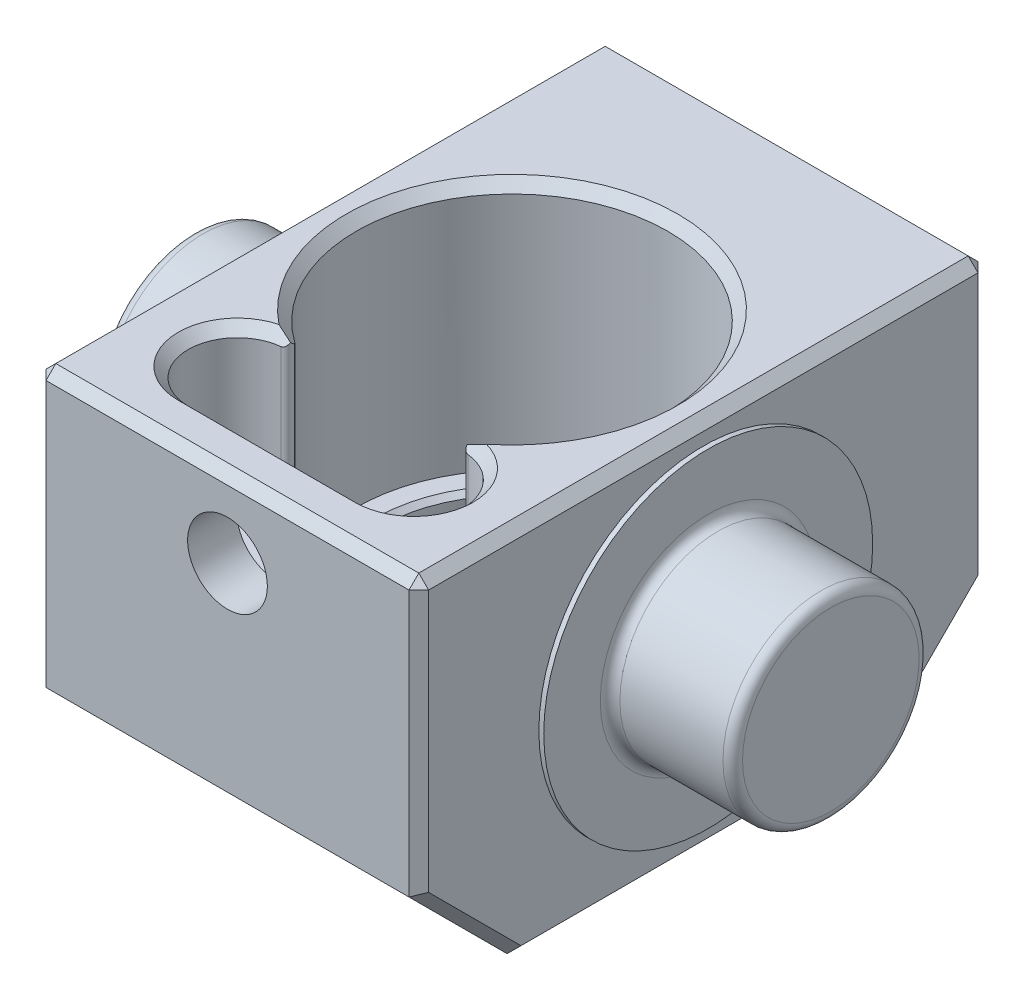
ISO-10303-21;
HEADER;
FILE_DESCRIPTION(('STEP AP214'),'2;1');
FILE_NAME('part.step','',(''),(''),'','','');
FILE_SCHEMA(('AUTOMOTIVE_DESIGN { 1 0 10303 214 1 1 1 1 }'));
ENDSEC;
DATA;
#1=APPLICATION_CONTEXT('core data for automotive mechanical design processes');
#2=APPLICATION_PROTOCOL_DEFINITION('international standard','automotive_design',2000,#1);
#3=PRODUCT_CONTEXT('',#1,'mechanical');
#4=PRODUCT('Part','Part','',(#3));
#5=PRODUCT_RELATED_PRODUCT_CATEGORY('part','',(#4));
#6=PRODUCT_DEFINITION_FORMATION('','',#4);
#7=PRODUCT_DEFINITION_CONTEXT('part definition',#1,'design');
#8=PRODUCT_DEFINITION('design','',#6,#7);
#9=PRODUCT_DEFINITION_SHAPE('','',#8);
#10=(LENGTH_UNIT() NAMED_UNIT(*) SI_UNIT(.MILLI.,.METRE.));
#11=(NAMED_UNIT(*) PLANE_ANGLE_UNIT() SI_UNIT($,.RADIAN.));
#12=(NAMED_UNIT(*) SI_UNIT($,.STERADIAN.) SOLID_ANGLE_UNIT());
#13=UNCERTAINTY_MEASURE_WITH_UNIT(LENGTH_MEASURE(1.E-05),#10,'distance_accuracy_value','');
#14=(GEOMETRIC_REPRESENTATION_CONTEXT(3) GLOBAL_UNCERTAINTY_ASSIGNED_CONTEXT((#13)) GLOBAL_UNIT_ASSIGNED_CONTEXT((#10,
#11,#12)) REPRESENTATION_CONTEXT('',''));
#15=CARTESIAN_POINT('',(0.,0.,0.));
#16=DIRECTION('',(0.,0.,1.));
#17=DIRECTION('',(1.,0.,0.));
#18=AXIS2_PLACEMENT_3D('',#15,#16,#17);
#19=CARTESIAN_POINT('',(-9.75,0.,0.));
#20=DIRECTION('',(1.,0.,0.));
#21=DIRECTION('',(0.,0.,-1.));
#22=AXIS2_PLACEMENT_3D('',#19,#20,#21);
#23=PLANE('',#22);
#24=DIRECTION('',(0.,0.707106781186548,0.707106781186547));
#25=VECTOR('',#24,1.);
#26=CARTESIAN_POINT('',(-9.75,-4.17144660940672,14.1464466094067));
#27=LINE('',#26,#25);
#28=CARTESIAN_POINT('',(-9.75,-9.02499999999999,9.29289321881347));
#29=VERTEX_POINT('',#28);
#30=CARTESIAN_POINT('',(-9.75,-4.31789321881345,14.));
#31=VERTEX_POINT('',#30);
#32=EDGE_CURVE('E301',#29,#31,#27,.T.);
#33=ORIENTED_EDGE('',*,*,#32,.T.);
#34=DIRECTION('',(0.,1.,0.));
#35=VECTOR('',#34,1.);
#36=CARTESIAN_POINT('',(-9.75,0.,14.));
#37=LINE('',#36,#35);
#38=CARTESIAN_POINT('',(-9.75,9.02499999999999,14.));
#39=VERTEX_POINT('',#38);
#40=EDGE_CURVE('E303',#31,#39,#37,.T.);
#41=ORIENTED_EDGE('',*,*,#40,.T.);
#42=DIRECTION('',(0.,0.,-1.));
#43=VECTOR('',#42,1.);
#44=CARTESIAN_POINT('',(-9.75,9.02499999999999,0.));
#45=LINE('',#44,#43);
#46=CARTESIAN_POINT('',(-9.75,9.02499999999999,-14.));
#47=VERTEX_POINT('',#46);
#48=EDGE_CURVE('E293',#39,#47,#45,.T.);
#49=ORIENTED_EDGE('',*,*,#48,.T.);
#50=DIRECTION('',(0.,-1.,0.));
#51=VECTOR('',#50,1.);
#52=CARTESIAN_POINT('',(-9.75,0.,-14.));
#53=LINE('',#52,#51);
#54=CARTESIAN_POINT('',(-9.75,-4.31789321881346,-14.));
#55=VERTEX_POINT('',#54);
#56=EDGE_CURVE('E295',#47,#55,#53,.T.);
#57=ORIENTED_EDGE('',*,*,#56,.T.);
#58=DIRECTION('',(0.,-0.707106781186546,0.707106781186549));
#59=VECTOR('',#58,1.);
#60=CARTESIAN_POINT('',(-9.75,-9.17144660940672,-9.14644660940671));
#61=LINE('',#60,#59);
#62=CARTESIAN_POINT('',(-9.75,-9.02499999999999,-9.29289321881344));
#63=VERTEX_POINT('',#62);
#64=EDGE_CURVE('E297',#55,#63,#61,.T.);
#65=ORIENTED_EDGE('',*,*,#64,.T.);
#66=DIRECTION('',(0.,0.,1.));
#67=VECTOR('',#66,1.);
#68=CARTESIAN_POINT('',(-9.75,-9.02499999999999,0.));
#69=LINE('',#68,#67);
#70=EDGE_CURVE('E299',#63,#29,#69,.T.);
#71=ORIENTED_EDGE('',*,*,#70,.T.);
#72=EDGE_LOOP('',(#33,#41,#49,#57,#65,#71));
#73=FACE_BOUND('',#72,.T.);
#74=CARTESIAN_POINT('',(-9.75,0.,0.));
#75=DIRECTION('',(1.,0.,0.));
#76=DIRECTION('',(0.,0.,-1.));
#77=AXIS2_PLACEMENT_3D('',#74,#75,#76);
#78=CIRCLE('',#77,8.382);
#79=CARTESIAN_POINT('',(-9.75,0.,-8.382));
#80=VERTEX_POINT('',#79);
#81=EDGE_CURVE('E238',#80,#80,#78,.F.);
#82=ORIENTED_EDGE('',*,*,#81,.F.);
#83=EDGE_LOOP('',(#82));
#84=FACE_BOUND('',#83,.T.);
#85=ADVANCED_FACE('F32',(#73,#84),#23,.F.);
#86=CARTESIAN_POINT('',(9.75,0.,0.));
#87=DIRECTION('',(1.,0.,0.));
#88=DIRECTION('',(0.,0.,-1.));
#89=AXIS2_PLACEMENT_3D('',#86,#87,#88);
#90=PLANE('',#89);
#91=DIRECTION('',(0.,-1.,0.));
#92=VECTOR('',#91,1.);
#93=CARTESIAN_POINT('',(9.75,-4.52499999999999,14.));
#94=LINE('',#93,#92);
#95=CARTESIAN_POINT('',(9.75,9.02499999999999,14.));
#96=VERTEX_POINT('',#95);
#97=CARTESIAN_POINT('',(9.75,-4.31789321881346,14.));
#98=VERTEX_POINT('',#97);
#99=EDGE_CURVE('E263',#96,#98,#94,.T.);
#100=ORIENTED_EDGE('',*,*,#99,.T.);
#101=DIRECTION('',(0.,-0.707106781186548,-0.707106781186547));
#102=VECTOR('',#101,1.);
#103=CARTESIAN_POINT('',(9.75,-9.15894660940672,9.15894660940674));
#104=LINE('',#103,#102);
#105=CARTESIAN_POINT('',(9.75,-9.02499999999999,9.29289321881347));
#106=VERTEX_POINT('',#105);
#107=EDGE_CURVE('E265',#98,#106,#104,.T.);
#108=ORIENTED_EDGE('',*,*,#107,.T.);
#109=DIRECTION('',(0.,0.,-1.));
#110=VECTOR('',#109,1.);
#111=CARTESIAN_POINT('',(9.75,-9.02499999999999,-9.49999999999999));
#112=LINE('',#111,#110);
#113=CARTESIAN_POINT('',(9.75,-9.02499999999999,-9.29289321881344));
#114=VERTEX_POINT('',#113);
#115=EDGE_CURVE('E261',#106,#114,#112,.T.);
#116=ORIENTED_EDGE('',*,*,#115,.T.);
#117=DIRECTION('',(0.,0.707106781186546,-0.707106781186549));
#118=VECTOR('',#117,1.);
#119=CARTESIAN_POINT('',(9.75,-9.15894660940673,-9.1589466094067));
#120=LINE('',#119,#118);
#121=CARTESIAN_POINT('',(9.75,-4.31789321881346,-14.));
#122=VERTEX_POINT('',#121);
#123=EDGE_CURVE('E259',#114,#122,#120,.T.);
#124=ORIENTED_EDGE('',*,*,#123,.T.);
#125=DIRECTION('',(0.,1.,0.));
#126=VECTOR('',#125,1.);
#127=CARTESIAN_POINT('',(9.75,9.525,-14.));
#128=LINE('',#127,#126);
#129=CARTESIAN_POINT('',(9.75,9.02499999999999,-14.));
#130=VERTEX_POINT('',#129);
#131=EDGE_CURVE('E257',#122,#130,#128,.T.);
#132=ORIENTED_EDGE('',*,*,#131,.T.);
#133=DIRECTION('',(0.,0.,1.));
#134=VECTOR('',#133,1.);
#135=CARTESIAN_POINT('',(9.75,9.02499999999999,14.5));
#136=LINE('',#135,#134);
#137=EDGE_CURVE('E255',#130,#96,#136,.T.);
#138=ORIENTED_EDGE('',*,*,#137,.T.);
#139=EDGE_LOOP('',(#100,#108,#116,#124,#132,#138));
#140=FACE_BOUND('',#139,.T.);
#141=CARTESIAN_POINT('',(9.75,0.,0.));
#142=DIRECTION('',(-1.,0.,0.));
#143=DIRECTION('',(0.,0.,1.));
#144=AXIS2_PLACEMENT_3D('',#141,#142,#143);
#145=CIRCLE('',#144,8.382);
#146=CARTESIAN_POINT('',(9.75,0.,8.382));
#147=VERTEX_POINT('',#146);
#148=EDGE_CURVE('E235',#147,#147,#145,.T.);
#149=ORIENTED_EDGE('',*,*,#148,.T.);
#150=EDGE_LOOP('',(#149));
#151=FACE_BOUND('',#150,.T.);
#152=ADVANCED_FACE('F486',(#140,#151),#90,.T.);
#153=CARTESIAN_POINT('',(9.75,9.525,-14.5));
#154=DIRECTION('',(0.,0.,1.));
#155=DIRECTION('',(1.,0.,0.));
#156=AXIS2_PLACEMENT_3D('',#153,#154,#155);
#157=PLANE('',#156);
#158=DIRECTION('',(1.,0.,0.));
#159=VECTOR('',#158,1.);
#160=CARTESIAN_POINT('',(9.75,9.02499999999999,-14.5));
#161=LINE('',#160,#159);
#162=CARTESIAN_POINT('',(-9.24999999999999,9.02499999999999,-14.5));
#163=VERTEX_POINT('',#162);
#164=CARTESIAN_POINT('',(9.24999999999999,9.02499999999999,-14.5));
#165=VERTEX_POINT('',#164);
#166=EDGE_CURVE('E287',#163,#165,#161,.T.);
#167=ORIENTED_EDGE('',*,*,#166,.T.);
#168=DIRECTION('',(0.,-1.,0.));
#169=VECTOR('',#168,1.);
#170=CARTESIAN_POINT('',(9.24999999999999,-4.52500000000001,-14.5));
#171=LINE('',#170,#169);
#172=CARTESIAN_POINT('',(9.24999999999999,-4.52500000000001,-14.5));
#173=VERTEX_POINT('',#172);
#174=EDGE_CURVE('E291',#165,#173,#171,.T.);
#175=ORIENTED_EDGE('',*,*,#174,.T.);
#176=DIRECTION('',(-1.,0.,0.));
#177=VECTOR('',#176,1.);
#178=CARTESIAN_POINT('',(9.75,-4.52500000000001,-14.5));
#179=LINE('',#178,#177);
#180=CARTESIAN_POINT('',(-9.24999999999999,-4.52500000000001,-14.5));
#181=VERTEX_POINT('',#180);
#182=EDGE_CURVE('E243',#173,#181,#179,.T.);
#183=ORIENTED_EDGE('',*,*,#182,.T.);
#184=DIRECTION('',(0.,1.,0.));
#185=VECTOR('',#184,1.);
#186=CARTESIAN_POINT('',(-9.24999999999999,9.525,-14.5));
#187=LINE('',#186,#185);
#188=EDGE_CURVE('E289',#181,#163,#187,.T.);
#189=ORIENTED_EDGE('',*,*,#188,.T.);
#190=EDGE_LOOP('',(#167,#175,#183,#189));
#191=FACE_BOUND('',#190,.T.);
#192=ADVANCED_FACE('F492',(#191),#157,.F.);
#193=CARTESIAN_POINT('',(9.75,9.525,14.5));
#194=DIRECTION('',(0.,-1.,0.));
#195=DIRECTION('',(0.,0.,-1.));
#196=AXIS2_PLACEMENT_3D('',#193,#194,#195);
#197=PLANE('',#196);
#198=CARTESIAN_POINT('',(4.5,9.525,9.49579));
#199=DIRECTION('',(0.,-1.,0.));
#200=DIRECTION('',(0.,0.,-1.));
#201=AXIS2_PLACEMENT_3D('',#198,#199,#200);
#202=CIRCLE('',#201,3.00990000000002);
#203=CARTESIAN_POINT('',(5.28717407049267,9.525,6.59064714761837));
#204=VERTEX_POINT('',#203);
#205=CARTESIAN_POINT('',(4.5,9.525,12.50569));
#206=VERTEX_POINT('',#205);
#207=EDGE_CURVE('E378',#204,#206,#202,.T.);
#208=ORIENTED_EDGE('',*,*,#207,.T.);
#209=DIRECTION('',(-1.,0.,0.));
#210=VECTOR('',#209,1.);
#211=CARTESIAN_POINT('',(9.75,9.525,12.50569));
#212=LINE('',#211,#210);
#213=CARTESIAN_POINT('',(-4.5,9.525,12.50569));
#214=VERTEX_POINT('',#213);
#215=EDGE_CURVE('E380',#206,#214,#212,.T.);
#216=ORIENTED_EDGE('',*,*,#215,.T.);
#217=CARTESIAN_POINT('',(-4.5,9.525,9.49579));
#218=DIRECTION('',(0.,-1.,0.));
#219=DIRECTION('',(0.,0.,-1.));
#220=AXIS2_PLACEMENT_3D('',#217,#218,#219);
#221=CIRCLE('',#220,3.00990000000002);
#222=CARTESIAN_POINT('',(-5.28717407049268,9.525,6.59064714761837));
#223=VERTEX_POINT('',#222);
#224=EDGE_CURVE('E374',#214,#223,#221,.T.);
#225=ORIENTED_EDGE('',*,*,#224,.T.);
#226=CARTESIAN_POINT('',(0.,9.525,0.));
#227=DIRECTION('',(0.,-1.,0.));
#228=DIRECTION('',(0.,0.,-1.));
#229=AXIS2_PLACEMENT_3D('',#226,#227,#228);
#230=CIRCLE('',#229,8.44931000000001);
#231=EDGE_CURVE('E376',#223,#204,#230,.T.);
#232=ORIENTED_EDGE('',*,*,#231,.T.);
#233=EDGE_LOOP('',(#208,#216,#225,#232));
#234=FACE_BOUND('',#233,.T.);
#235=DIRECTION('',(0.,0.,-1.));
#236=VECTOR('',#235,1.);
#237=CARTESIAN_POINT('',(9.24999999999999,9.525,-14.5));
#238=LINE('',#237,#236);
#239=CARTESIAN_POINT('',(9.24999999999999,9.525,14.));
#240=VERTEX_POINT('',#239);
#241=CARTESIAN_POINT('',(9.24999999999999,9.525,-14.));
#242=VERTEX_POINT('',#241);
#243=EDGE_CURVE('E310',#240,#242,#238,.T.);
#244=ORIENTED_EDGE('',*,*,#243,.T.);
#245=DIRECTION('',(-1.,0.,0.));
#246=VECTOR('',#245,1.);
#247=CARTESIAN_POINT('',(9.75,9.525,-14.));
#248=LINE('',#247,#246);
#249=CARTESIAN_POINT('',(-9.24999999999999,9.525,-14.));
#250=VERTEX_POINT('',#249);
#251=EDGE_CURVE('E312',#242,#250,#248,.T.);
#252=ORIENTED_EDGE('',*,*,#251,.T.);
#253=DIRECTION('',(0.,0.,1.));
#254=VECTOR('',#253,1.);
#255=CARTESIAN_POINT('',(-9.24999999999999,9.525,14.5));
#256=LINE('',#255,#254);
#257=CARTESIAN_POINT('',(-9.24999999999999,9.525,14.));
#258=VERTEX_POINT('',#257);
#259=EDGE_CURVE('E306',#250,#258,#256,.T.);
#260=ORIENTED_EDGE('',*,*,#259,.T.);
#261=DIRECTION('',(1.,0.,0.));
#262=VECTOR('',#261,1.);
#263=CARTESIAN_POINT('',(9.75,9.525,14.));
#264=LINE('',#263,#262);
#265=EDGE_CURVE('E308',#258,#240,#264,.T.);
#266=ORIENTED_EDGE('',*,*,#265,.T.);
#267=EDGE_LOOP('',(#244,#252,#260,#266));
#268=FACE_BOUND('',#267,.T.);
#269=ADVANCED_FACE('F506',(#234,#268),#197,.F.);
#270=CARTESIAN_POINT('',(9.75,9.525,14.5));
#271=DIRECTION('',(0.,0.,-1.));
#272=DIRECTION('',(0.,1.,0.));
#273=AXIS2_PLACEMENT_3D('',#270,#271,#272);
#274=PLANE('',#273);
#275=CARTESIAN_POINT('',(0.,5.585,14.5));
#276=DIRECTION('',(0.,0.,1.));
#277=DIRECTION('',(1.,0.,0.));
#278=AXIS2_PLACEMENT_3D('',#275,#276,#277);
#279=CIRCLE('',#278,2.032);
#280=CARTESIAN_POINT('',(2.032,5.585,14.5));
#281=VERTEX_POINT('',#280);
#282=EDGE_CURVE('E394',#281,#281,#279,.T.);
#283=ORIENTED_EDGE('',*,*,#282,.F.);
#284=EDGE_LOOP('',(#283));
#285=FACE_BOUND('',#284,.T.);
#286=DIRECTION('',(1.,0.,0.));
#287=VECTOR('',#286,1.);
#288=CARTESIAN_POINT('',(9.75,-4.525,14.5));
#289=LINE('',#288,#287);
#290=CARTESIAN_POINT('',(-9.24999999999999,-4.525,14.5));
#291=VERTEX_POINT('',#290);
#292=CARTESIAN_POINT('',(9.24999999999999,-4.525,14.5));
#293=VERTEX_POINT('',#292);
#294=EDGE_CURVE('E252',#291,#293,#289,.T.);
#295=ORIENTED_EDGE('',*,*,#294,.T.);
#296=DIRECTION('',(0.,1.,0.));
#297=VECTOR('',#296,1.);
#298=CARTESIAN_POINT('',(9.24999999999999,9.525,14.5));
#299=LINE('',#298,#297);
#300=CARTESIAN_POINT('',(9.24999999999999,9.02499999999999,14.5));
#301=VERTEX_POINT('',#300);
#302=EDGE_CURVE('E277',#293,#301,#299,.T.);
#303=ORIENTED_EDGE('',*,*,#302,.T.);
#304=DIRECTION('',(-1.,0.,0.));
#305=VECTOR('',#304,1.);
#306=CARTESIAN_POINT('',(9.75,9.02499999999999,14.5));
#307=LINE('',#306,#305);
#308=CARTESIAN_POINT('',(-9.24999999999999,9.02499999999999,14.5));
#309=VERTEX_POINT('',#308);
#310=EDGE_CURVE('E273',#301,#309,#307,.T.);
#311=ORIENTED_EDGE('',*,*,#310,.T.);
#312=DIRECTION('',(0.,-1.,0.));
#313=VECTOR('',#312,1.);
#314=CARTESIAN_POINT('',(-9.24999999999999,9.525,14.5));
#315=LINE('',#314,#313);
#316=EDGE_CURVE('E275',#309,#291,#315,.T.);
#317=ORIENTED_EDGE('',*,*,#316,.T.);
#318=EDGE_LOOP('',(#295,#303,#311,#317));
#319=FACE_BOUND('',#318,.T.);
#320=ADVANCED_FACE('F502',(#285,#319),#274,.F.);
#321=CARTESIAN_POINT('',(9.75,-9.525,14.5));
#322=DIRECTION('',(0.,1.,0.));
#323=DIRECTION('',(0.,0.,1.));
#324=AXIS2_PLACEMENT_3D('',#321,#322,#323);
#325=PLANE('',#324);
#326=CARTESIAN_POINT('',(0.,-9.525,0.));
#327=DIRECTION('',(0.,1.,0.));
#328=DIRECTION('',(0.,0.,1.));
#329=AXIS2_PLACEMENT_3D('',#326,#327,#328);
#330=CIRCLE('',#329,6.98499999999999);
#331=CARTESIAN_POINT('',(0.,-9.525,6.98499999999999));
#332=VERTEX_POINT('',#331);
#333=EDGE_CURVE('E627',#332,#332,#330,.T.);
#334=ORIENTED_EDGE('',*,*,#333,.T.);
#335=EDGE_LOOP('',(#334));
#336=FACE_BOUND('',#335,.T.);
#337=DIRECTION('',(1.,0.,0.));
#338=VECTOR('',#337,1.);
#339=CARTESIAN_POINT('',(9.75,-9.525,-9.49999999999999));
#340=LINE('',#339,#338);
#341=CARTESIAN_POINT('',(-9.24999999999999,-9.525,-9.49999999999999));
#342=VERTEX_POINT('',#341);
#343=CARTESIAN_POINT('',(9.24999999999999,-9.525,-9.49999999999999));
#344=VERTEX_POINT('',#343);
#345=EDGE_CURVE('E249',#342,#344,#340,.T.);
#346=ORIENTED_EDGE('',*,*,#345,.T.);
#347=DIRECTION('',(0.,0.,1.));
#348=VECTOR('',#347,1.);
#349=CARTESIAN_POINT('',(9.24999999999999,-9.525,9.50000000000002));
#350=LINE('',#349,#348);
#351=CARTESIAN_POINT('',(9.24999999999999,-9.525,9.50000000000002));
#352=VERTEX_POINT('',#351);
#353=EDGE_CURVE('E281',#344,#352,#350,.T.);
#354=ORIENTED_EDGE('',*,*,#353,.T.);
#355=DIRECTION('',(-1.,0.,0.));
#356=VECTOR('',#355,1.);
#357=CARTESIAN_POINT('',(9.75,-9.525,9.50000000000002));
#358=LINE('',#357,#356);
#359=CARTESIAN_POINT('',(-9.24999999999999,-9.525,9.50000000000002));
#360=VERTEX_POINT('',#359);
#361=EDGE_CURVE('E246',#352,#360,#358,.T.);
#362=ORIENTED_EDGE('',*,*,#361,.T.);
#363=DIRECTION('',(0.,0.,-1.));
#364=VECTOR('',#363,1.);
#365=CARTESIAN_POINT('',(-9.24999999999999,-9.525,14.5));
#366=LINE('',#365,#364);
#367=EDGE_CURVE('E279',#360,#342,#366,.T.);
#368=ORIENTED_EDGE('',*,*,#367,.T.);
#369=EDGE_LOOP('',(#346,#354,#362,#368));
#370=FACE_BOUND('',#369,.T.);
#371=ADVANCED_FACE('F498',(#336,#370),#325,.F.);
#372=CARTESIAN_POINT('',(0.,0.,0.));
#373=DIRECTION('',(-1.,0.,0.));
#374=DIRECTION('',(0.,0.,1.));
#375=AXIS2_PLACEMENT_3D('',#372,#373,#374);
#376=CYLINDRICAL_SURFACE('',#375,8.382);
#377=ORIENTED_EDGE('',*,*,#148,.F.);
#378=EDGE_LOOP('',(#377));
#379=FACE_BOUND('',#378,.T.);
#380=CARTESIAN_POINT('',(10.,0.,0.));
#381=DIRECTION('',(-1.,0.,0.));
#382=DIRECTION('',(0.,0.,1.));
#383=AXIS2_PLACEMENT_3D('',#380,#381,#382);
#384=CIRCLE('',#383,8.382);
#385=CARTESIAN_POINT('',(10.,0.,8.382));
#386=VERTEX_POINT('',#385);
#387=EDGE_CURVE('E232',#386,#386,#384,.T.);
#388=ORIENTED_EDGE('',*,*,#387,.T.);
#389=EDGE_LOOP('',(#388));
#390=FACE_BOUND('',#389,.T.);
#391=ADVANCED_FACE('F501',(#379,#390),#376,.T.);
#392=CARTESIAN_POINT('',(10.,8.382,0.));
#393=DIRECTION('',(-1.,0.,0.));
#394=DIRECTION('',(0.,0.,1.));
#395=AXIS2_PLACEMENT_3D('',#392,#393,#394);
#396=PLANE('',#395);
#397=CARTESIAN_POINT('',(10.,0.,0.));
#398=DIRECTION('',(-1.,0.,0.));
#399=DIRECTION('',(0.,0.,1.));
#400=AXIS2_PLACEMENT_3D('',#397,#398,#399);
#401=CIRCLE('',#400,5.500000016);
#402=CARTESIAN_POINT('',(10.,0.,5.500000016));
#403=VERTEX_POINT('',#402);
#404=EDGE_CURVE('E642',#403,#403,#401,.T.);
#405=ORIENTED_EDGE('',*,*,#404,.T.);
#406=EDGE_LOOP('',(#405));
#407=FACE_BOUND('',#406,.T.);
#408=ORIENTED_EDGE('',*,*,#387,.F.);
#409=EDGE_LOOP('',(#408));
#410=FACE_BOUND('',#409,.T.);
#411=ADVANCED_FACE('F688',(#407,#410),#396,.F.);
#412=CARTESIAN_POINT('',(0.,0.,0.));
#413=DIRECTION('',(-1.,0.,0.));
#414=DIRECTION('',(0.,0.,1.));
#415=AXIS2_PLACEMENT_3D('',#412,#413,#414);
#416=CYLINDRICAL_SURFACE('',#415,5.);
#417=CARTESIAN_POINT('',(10.500000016,0.,0.));
#418=DIRECTION('',(-1.,0.,0.));
#419=DIRECTION('',(0.,0.,1.));
#420=AXIS2_PLACEMENT_3D('',#417,#418,#419);
#421=CIRCLE('',#420,5.);
#422=CARTESIAN_POINT('',(10.500000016,0.,5.));
#423=VERTEX_POINT('',#422);
#424=EDGE_CURVE('E645',#423,#423,#421,.F.);
#425=ORIENTED_EDGE('',*,*,#424,.T.);
#426=EDGE_LOOP('',(#425));
#427=FACE_BOUND('',#426,.T.);
#428=CARTESIAN_POINT('',(15.749999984,0.,0.));
#429=DIRECTION('',(-1.,0.,0.));
#430=DIRECTION('',(0.,0.,1.));
#431=AXIS2_PLACEMENT_3D('',#428,#429,#430);
#432=CIRCLE('',#431,5.);
#433=CARTESIAN_POINT('',(15.749999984,0.,5.));
#434=VERTEX_POINT('',#433);
#435=EDGE_CURVE('E636',#434,#434,#432,.T.);
#436=ORIENTED_EDGE('',*,*,#435,.T.);
#437=EDGE_LOOP('',(#436));
#438=FACE_BOUND('',#437,.T.);
#439=ADVANCED_FACE('F681',(#427,#438),#416,.T.);
#440=CARTESIAN_POINT('',(16.25,5.,0.));
#441=DIRECTION('',(-1.,0.,0.));
#442=DIRECTION('',(0.,0.,1.));
#443=AXIS2_PLACEMENT_3D('',#440,#441,#442);
#444=PLANE('',#443);
#445=CARTESIAN_POINT('',(16.25,0.,0.));
#446=DIRECTION('',(-1.,0.,0.));
#447=DIRECTION('',(0.,0.,1.));
#448=AXIS2_PLACEMENT_3D('',#445,#446,#447);
#449=CIRCLE('',#448,4.499999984);
#450=CARTESIAN_POINT('',(16.25,0.,4.499999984));
#451=VERTEX_POINT('',#450);
#452=EDGE_CURVE('E639',#451,#451,#449,.F.);
#453=ORIENTED_EDGE('',*,*,#452,.T.);
#454=EDGE_LOOP('',(#453));
#455=FACE_BOUND('',#454,.T.);
#456=ADVANCED_FACE('F675',(#455),#444,.F.);
#457=CARTESIAN_POINT('',(0.,0.,0.));
#458=DIRECTION('',(1.,0.,0.));
#459=DIRECTION('',(0.,0.,1.));
#460=AXIS2_PLACEMENT_3D('',#457,#458,#459);
#461=CYLINDRICAL_SURFACE('',#460,8.382);
#462=ORIENTED_EDGE('',*,*,#81,.T.);
#463=EDGE_LOOP('',(#462));
#464=FACE_BOUND('',#463,.T.);
#465=CARTESIAN_POINT('',(-10.,0.,0.));
#466=DIRECTION('',(-1.,0.,0.));
#467=DIRECTION('',(0.,0.,1.));
#468=AXIS2_PLACEMENT_3D('',#465,#466,#467);
#469=CIRCLE('',#468,8.382);
#470=CARTESIAN_POINT('',(-10.,0.,8.382));
#471=VERTEX_POINT('',#470);
#472=EDGE_CURVE('E229',#471,#471,#469,.T.);
#473=ORIENTED_EDGE('',*,*,#472,.F.);
#474=EDGE_LOOP('',(#473));
#475=FACE_BOUND('',#474,.T.);
#476=ADVANCED_FACE('F670',(#464,#475),#461,.T.);
#477=CARTESIAN_POINT('',(-10.,8.382,0.));
#478=DIRECTION('',(1.,0.,0.));
#479=DIRECTION('',(0.,0.,1.));
#480=AXIS2_PLACEMENT_3D('',#477,#478,#479);
#481=PLANE('',#480);
#482=CARTESIAN_POINT('',(-10.,0.,0.));
#483=DIRECTION('',(1.,0.,0.));
#484=DIRECTION('',(0.,0.,-1.));
#485=AXIS2_PLACEMENT_3D('',#482,#483,#484);
#486=CIRCLE('',#485,5.500000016);
#487=CARTESIAN_POINT('',(-10.,0.,-5.500000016));
#488=VERTEX_POINT('',#487);
#489=EDGE_CURVE('E11',#488,#488,#486,.T.);
#490=ORIENTED_EDGE('',*,*,#489,.T.);
#491=EDGE_LOOP('',(#490));
#492=FACE_BOUND('',#491,.T.);
#493=ORIENTED_EDGE('',*,*,#472,.T.);
#494=EDGE_LOOP('',(#493));
#495=FACE_BOUND('',#494,.T.);
#496=ADVANCED_FACE('F667',(#492,#495),#481,.F.);
#497=CARTESIAN_POINT('',(0.,0.,0.));
#498=DIRECTION('',(1.,0.,0.));
#499=DIRECTION('',(0.,0.,1.));
#500=AXIS2_PLACEMENT_3D('',#497,#498,#499);
#501=CYLINDRICAL_SURFACE('',#500,5.);
#502=CARTESIAN_POINT('',(-10.500000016,0.,0.));
#503=DIRECTION('',(1.,0.,0.));
#504=DIRECTION('',(0.,0.,-1.));
#505=AXIS2_PLACEMENT_3D('',#502,#503,#504);
#506=CIRCLE('',#505,5.);
#507=CARTESIAN_POINT('',(-10.500000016,0.,-5.));
#508=VERTEX_POINT('',#507);
#509=EDGE_CURVE('E40',#508,#508,#506,.F.);
#510=ORIENTED_EDGE('',*,*,#509,.T.);
#511=EDGE_LOOP('',(#510));
#512=FACE_BOUND('',#511,.T.);
#513=CARTESIAN_POINT('',(-15.749999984,0.,0.));
#514=DIRECTION('',(1.,0.,0.));
#515=DIRECTION('',(0.,0.,-1.));
#516=AXIS2_PLACEMENT_3D('',#513,#514,#515);
#517=CIRCLE('',#516,5.);
#518=CARTESIAN_POINT('',(-15.749999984,0.,-5.));
#519=VERTEX_POINT('',#518);
#520=EDGE_CURVE('E633',#519,#519,#517,.T.);
#521=ORIENTED_EDGE('',*,*,#520,.T.);
#522=EDGE_LOOP('',(#521));
#523=FACE_BOUND('',#522,.T.);
#524=ADVANCED_FACE('F650',(#512,#523),#501,.T.);
#525=CARTESIAN_POINT('',(-16.25,5.,0.));
#526=DIRECTION('',(1.,0.,0.));
#527=DIRECTION('',(0.,0.,1.));
#528=AXIS2_PLACEMENT_3D('',#525,#526,#527);
#529=PLANE('',#528);
#530=CARTESIAN_POINT('',(-16.25,0.,0.));
#531=DIRECTION('',(1.,0.,0.));
#532=DIRECTION('',(0.,0.,-1.));
#533=AXIS2_PLACEMENT_3D('',#530,#531,#532);
#534=CIRCLE('',#533,4.499999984);
#535=CARTESIAN_POINT('',(-16.25,0.,-4.499999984));
#536=VERTEX_POINT('',#535);
#537=EDGE_CURVE('E630',#536,#536,#534,.F.);
#538=ORIENTED_EDGE('',*,*,#537,.T.);
#539=EDGE_LOOP('',(#538));
#540=FACE_BOUND('',#539,.T.);
#541=ADVANCED_FACE('F729',(#540),#529,.F.);
#542=CARTESIAN_POINT('',(0.,-3.175,0.));
#543=DIRECTION('',(0.,-1.,0.));
#544=DIRECTION('',(0.,0.,-1.));
#545=AXIS2_PLACEMENT_3D('',#542,#543,#544);
#546=PLANE('',#545);
#547=CARTESIAN_POINT('',(0.,-3.175,0.));
#548=DIRECTION('',(0.,-1.,0.));
#549=DIRECTION('',(0.,0.,-1.));
#550=AXIS2_PLACEMENT_3D('',#547,#548,#549);
#551=CIRCLE('',#550,6.98499999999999);
#552=CARTESIAN_POINT('',(0.,-3.175,-6.98499999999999));
#553=VERTEX_POINT('',#552);
#554=EDGE_CURVE('E624',#553,#553,#551,.T.);
#555=ORIENTED_EDGE('',*,*,#554,.T.);
#556=EDGE_LOOP('',(#555));
#557=FACE_BOUND('',#556,.T.);
#558=CARTESIAN_POINT('',(0.,-3.175,0.));
#559=DIRECTION('',(0.,1.,0.));
#560=DIRECTION('',(0.,0.,1.));
#561=AXIS2_PLACEMENT_3D('',#558,#559,#560);
#562=CIRCLE('',#561,7.94131);
#563=CARTESIAN_POINT('',(0.,-3.175,7.94131));
#564=VERTEX_POINT('',#563);
#565=EDGE_CURVE('E225',#564,#564,#562,.T.);
#566=ORIENTED_EDGE('',*,*,#565,.T.);
#567=EDGE_LOOP('',(#566));
#568=FACE_BOUND('',#567,.T.);
#569=ADVANCED_FACE('F734',(#557,#568),#546,.F.);
#570=CARTESIAN_POINT('',(0.,10.1246822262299,0.));
#571=DIRECTION('',(0.,1.,0.));
#572=DIRECTION('',(0.,0.,1.));
#573=AXIS2_PLACEMENT_3D('',#570,#571,#572);
#574=CYLINDRICAL_SURFACE('',#573,7.94131);
#575=CARTESIAN_POINT('',(0.,3.025,0.));
#576=DIRECTION('',(0.,1.,0.));
#577=DIRECTION('',(0.,0.,1.));
#578=AXIS2_PLACEMENT_3D('',#575,#576,#577);
#579=CIRCLE('',#578,7.94131);
#580=CARTESIAN_POINT('',(4.61257995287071,3.025,6.46440335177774));
#581=VERTEX_POINT('',#580);
#582=CARTESIAN_POINT('',(-4.61257995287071,3.025,6.46440335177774));
#583=VERTEX_POINT('',#582);
#584=EDGE_CURVE('E241',#581,#583,#579,.F.);
#585=ORIENTED_EDGE('',*,*,#584,.F.);
#586=DIRECTION('',(0.,1.,0.));
#587=VECTOR('',#586,1.);
#588=CARTESIAN_POINT('',(4.61257995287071,10.1246822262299,6.46440335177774));
#589=LINE('',#588,#587);
#590=CARTESIAN_POINT('',(4.61257995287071,9.01699999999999,6.46440335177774));
#591=VERTEX_POINT('',#590);
#592=EDGE_CURVE('E453',#581,#591,#589,.T.);
#593=ORIENTED_EDGE('',*,*,#592,.T.);
#594=CARTESIAN_POINT('',(0.,9.01699999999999,0.));
#595=DIRECTION('',(0.,-1.,0.));
#596=DIRECTION('',(0.,0.,-1.));
#597=AXIS2_PLACEMENT_3D('',#594,#595,#596);
#598=CIRCLE('',#597,7.94131);
#599=CARTESIAN_POINT('',(-4.61257995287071,9.01699999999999,6.46440335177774));
#600=VERTEX_POINT('',#599);
#601=EDGE_CURVE('E386',#591,#600,#598,.F.);
#602=ORIENTED_EDGE('',*,*,#601,.T.);
#603=DIRECTION('',(0.,1.,0.));
#604=VECTOR('',#603,1.);
#605=CARTESIAN_POINT('',(-4.61257995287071,10.1246822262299,6.46440335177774));
#606=LINE('',#605,#604);
#607=EDGE_CURVE('E390',#600,#583,#606,.F.);
#608=ORIENTED_EDGE('',*,*,#607,.T.);
#609=EDGE_LOOP('',(#585,#593,#602,#608));
#610=FACE_BOUND('',#609,.T.);
#611=ORIENTED_EDGE('',*,*,#565,.F.);
#612=EDGE_LOOP('',(#611));
#613=FACE_BOUND('',#612,.T.);
#614=ADVANCED_FACE('F898',(#610,#613),#574,.F.);
#615=CARTESIAN_POINT('',(0.,-1.92521317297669,0.));
#616=DIRECTION('',(0.,1.,0.));
#617=DIRECTION('',(0.,0.,1.));
#618=AXIS2_PLACEMENT_3D('',#615,#616,#617);
#619=CYLINDRICAL_SURFACE('',#618,6.731);
#620=CARTESIAN_POINT('',(0.,-3.42899999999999,0.));
#621=DIRECTION('',(0.,-1.,0.));
#622=DIRECTION('',(0.,0.,-1.));
#623=AXIS2_PLACEMENT_3D('',#620,#621,#622);
#624=CIRCLE('',#623,6.731);
#625=CARTESIAN_POINT('',(0.,-3.42899999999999,-6.731));
#626=VERTEX_POINT('',#625);
#627=EDGE_CURVE('E621',#626,#626,#624,.F.);
#628=ORIENTED_EDGE('',*,*,#627,.T.);
#629=EDGE_LOOP('',(#628));
#630=FACE_BOUND('',#629,.T.);
#631=CARTESIAN_POINT('',(0.,-9.271,0.));
#632=DIRECTION('',(0.,1.,0.));
#633=DIRECTION('',(0.,0.,1.));
#634=AXIS2_PLACEMENT_3D('',#631,#632,#633);
#635=CIRCLE('',#634,6.731);
#636=CARTESIAN_POINT('',(0.,-9.271,6.731));
#637=VERTEX_POINT('',#636);
#638=EDGE_CURVE('E614',#637,#637,#635,.F.);
#639=ORIENTED_EDGE('',*,*,#638,.T.);
#640=EDGE_LOOP('',(#639));
#641=FACE_BOUND('',#640,.T.);
#642=ADVANCED_FACE('F903',(#630,#641),#619,.F.);
#643=CARTESIAN_POINT('',(-4.5,3.025,9.49579));
#644=DIRECTION('',(0.,1.,0.));
#645=DIRECTION('',(0.,0.,1.));
#646=AXIS2_PLACEMENT_3D('',#643,#644,#645);
#647=PLANE('',#646);
#648=ORIENTED_EDGE('',*,*,#584,.T.);
#649=CARTESIAN_POINT('',(-4.78683004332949,3.025,6.7086100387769));
#650=DIRECTION('',(0.,1.,0.));
#651=DIRECTION('',(0.,0.,1.));
#652=AXIS2_PLACEMENT_3D('',#649,#650,#651);
#653=CIRCLE('',#652,0.3);
#654=CARTESIAN_POINT('',(-4.7561190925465,3.025,7.00703396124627));
#655=VERTEX_POINT('',#654);
#656=EDGE_CURVE('E55',#583,#655,#653,.F.);
#657=ORIENTED_EDGE('',*,*,#656,.T.);
#658=CARTESIAN_POINT('',(-4.5,3.025,9.49579));
#659=DIRECTION('',(0.,1.,0.));
#660=DIRECTION('',(0.,0.,1.));
#661=AXIS2_PLACEMENT_3D('',#658,#659,#660);
#662=CIRCLE('',#661,2.5019);
#663=CARTESIAN_POINT('',(-4.5,3.025,11.99769));
#664=VERTEX_POINT('',#663);
#665=EDGE_CURVE('E198',#655,#664,#662,.T.);
#666=ORIENTED_EDGE('',*,*,#665,.T.);
#667=DIRECTION('',(1.,0.,0.));
#668=VECTOR('',#667,1.);
#669=CARTESIAN_POINT('',(-4.5,3.025,11.99769));
#670=LINE('',#669,#668);
#671=CARTESIAN_POINT('',(4.5,3.025,11.99769));
#672=VERTEX_POINT('',#671);
#673=EDGE_CURVE('E203',#664,#672,#670,.T.);
#674=ORIENTED_EDGE('',*,*,#673,.T.);
#675=CARTESIAN_POINT('',(4.5,3.025,9.49579));
#676=DIRECTION('',(0.,1.,0.));
#677=DIRECTION('',(0.,0.,1.));
#678=AXIS2_PLACEMENT_3D('',#675,#676,#677);
#679=CIRCLE('',#678,2.5019);
#680=CARTESIAN_POINT('',(4.7561190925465,3.025,7.00703396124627));
#681=VERTEX_POINT('',#680);
#682=EDGE_CURVE('E216',#672,#681,#679,.T.);
#683=ORIENTED_EDGE('',*,*,#682,.T.);
#684=CARTESIAN_POINT('',(4.78683004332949,3.025,6.7086100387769));
#685=DIRECTION('',(0.,1.,0.));
#686=DIRECTION('',(0.,0.,1.));
#687=AXIS2_PLACEMENT_3D('',#684,#685,#686);
#688=CIRCLE('',#687,0.3);
#689=EDGE_CURVE('E610',#681,#581,#688,.F.);
#690=ORIENTED_EDGE('',*,*,#689,.T.);
#691=EDGE_LOOP('',(#648,#657,#666,#674,#683,#690));
#692=FACE_BOUND('',#691,.T.);
#693=ADVANCED_FACE('F200',(#692),#647,.T.);
#694=CARTESIAN_POINT('',(-4.5,3.025,9.49579));
#695=DIRECTION('',(0.,1.,0.));
#696=DIRECTION('',(0.,0.,1.));
#697=AXIS2_PLACEMENT_3D('',#694,#695,#696);
#698=CYLINDRICAL_SURFACE('',#697,2.5019);
#699=ORIENTED_EDGE('',*,*,#665,.F.);
#700=DIRECTION('',(0.,1.,0.));
#701=VECTOR('',#700,1.);
#702=CARTESIAN_POINT('',(-4.7561190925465,3.025,7.00703396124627));
#703=LINE('',#702,#701);
#704=CARTESIAN_POINT('',(-4.7561190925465,9.01699999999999,7.00703396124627));
#705=VERTEX_POINT('',#704);
#706=EDGE_CURVE('E1096',#655,#705,#703,.T.);
#707=ORIENTED_EDGE('',*,*,#706,.T.);
#708=CARTESIAN_POINT('',(-4.5,9.01699999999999,9.49579));
#709=DIRECTION('',(0.,-1.,0.));
#710=DIRECTION('',(0.,0.,-1.));
#711=AXIS2_PLACEMENT_3D('',#708,#709,#710);
#712=CIRCLE('',#711,2.5019);
#713=CARTESIAN_POINT('',(-4.5,9.01699999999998,11.99769));
#714=VERTEX_POINT('',#713);
#715=EDGE_CURVE('E211',#705,#714,#712,.F.);
#716=ORIENTED_EDGE('',*,*,#715,.T.);
#717=DIRECTION('',(0.,1.,0.));
#718=VECTOR('',#717,1.);
#719=CARTESIAN_POINT('',(-4.5,3.025,11.99769));
#720=LINE('',#719,#718);
#721=EDGE_CURVE('E209',#664,#714,#720,.T.);
#722=ORIENTED_EDGE('',*,*,#721,.F.);
#723=EDGE_LOOP('',(#699,#707,#716,#722));
#724=FACE_BOUND('',#723,.T.);
#725=ADVANCED_FACE('F210',(#724),#698,.F.);
#726=CARTESIAN_POINT('',(4.5,3.025,9.49579));
#727=DIRECTION('',(0.,1.,0.));
#728=DIRECTION('',(0.,0.,1.));
#729=AXIS2_PLACEMENT_3D('',#726,#727,#728);
#730=CYLINDRICAL_SURFACE('',#729,2.5019);
#731=CARTESIAN_POINT('',(4.5,9.01699999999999,9.49579));
#732=DIRECTION('',(0.,-1.,0.));
#733=DIRECTION('',(0.,0.,-1.));
#734=AXIS2_PLACEMENT_3D('',#731,#732,#733);
#735=CIRCLE('',#734,2.5019);
#736=CARTESIAN_POINT('',(4.5,9.01699999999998,11.99769));
#737=VERTEX_POINT('',#736);
#738=CARTESIAN_POINT('',(4.7561190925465,9.01699999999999,7.00703396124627));
#739=VERTEX_POINT('',#738);
#740=EDGE_CURVE('E383',#737,#739,#735,.F.);
#741=ORIENTED_EDGE('',*,*,#740,.T.);
#742=DIRECTION('',(0.,1.,0.));
#743=VECTOR('',#742,1.);
#744=CARTESIAN_POINT('',(4.7561190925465,3.025,7.00703396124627));
#745=LINE('',#744,#743);
#746=EDGE_CURVE('E427',#739,#681,#745,.F.);
#747=ORIENTED_EDGE('',*,*,#746,.T.);
#748=ORIENTED_EDGE('',*,*,#682,.F.);
#749=DIRECTION('',(0.,1.,0.));
#750=VECTOR('',#749,1.);
#751=CARTESIAN_POINT('',(4.5,3.025,11.99769));
#752=LINE('',#751,#750);
#753=EDGE_CURVE('E215',#672,#737,#752,.T.);
#754=ORIENTED_EDGE('',*,*,#753,.T.);
#755=EDGE_LOOP('',(#741,#747,#748,#754));
#756=FACE_BOUND('',#755,.T.);
#757=ADVANCED_FACE('F607',(#756),#730,.F.);
#758=CARTESIAN_POINT('',(-4.5,3.025,11.99769));
#759=DIRECTION('',(0.,0.,1.));
#760=DIRECTION('',(1.,0.,0.));
#761=AXIS2_PLACEMENT_3D('',#758,#759,#760);
#762=PLANE('',#761);
#763=CARTESIAN_POINT('',(0.,5.585,11.99769));
#764=DIRECTION('',(0.,0.,1.));
#765=DIRECTION('',(1.,0.,0.));
#766=AXIS2_PLACEMENT_3D('',#763,#764,#765);
#767=CIRCLE('',#766,2.032);
#768=CARTESIAN_POINT('',(2.032,5.585,11.99769));
#769=VERTEX_POINT('',#768);
#770=EDGE_CURVE('E1148',#769,#769,#767,.F.);
#771=ORIENTED_EDGE('',*,*,#770,.F.);
#772=EDGE_LOOP('',(#771));
#773=FACE_BOUND('',#772,.T.);
#774=ORIENTED_EDGE('',*,*,#721,.T.);
#775=DIRECTION('',(1.,0.,0.));
#776=VECTOR('',#775,1.);
#777=CARTESIAN_POINT('',(-4.5,9.01699999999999,11.99769));
#778=LINE('',#777,#776);
#779=EDGE_CURVE('E315',#714,#737,#778,.T.);
#780=ORIENTED_EDGE('',*,*,#779,.T.);
#781=ORIENTED_EDGE('',*,*,#753,.F.);
#782=ORIENTED_EDGE('',*,*,#673,.F.);
#783=EDGE_LOOP('',(#774,#780,#781,#782));
#784=FACE_BOUND('',#783,.T.);
#785=ADVANCED_FACE('F218',(#773,#784),#762,.F.);
#786=CARTESIAN_POINT('',(9.75,-4.52500000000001,-14.5));
#787=DIRECTION('',(0.,0.707106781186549,0.707106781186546));
#788=DIRECTION('',(-1.,0.,0.));
#789=AXIS2_PLACEMENT_3D('',#786,#787,#788);
#790=PLANE('',#789);
#791=ORIENTED_EDGE('',*,*,#182,.F.);
#792=DIRECTION('',(0.,0.707106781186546,-0.707106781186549));
#793=VECTOR('',#792,1.);
#794=CARTESIAN_POINT('',(9.24999999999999,-4.52500000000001,-14.5));
#795=LINE('',#794,#793);
#796=EDGE_CURVE('E285',#173,#344,#795,.F.);
#797=ORIENTED_EDGE('',*,*,#796,.T.);
#798=ORIENTED_EDGE('',*,*,#345,.F.);
#799=DIRECTION('',(0.,-0.707106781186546,0.707106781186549));
#800=VECTOR('',#799,1.);
#801=CARTESIAN_POINT('',(-9.24999999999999,-4.52500000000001,-14.5));
#802=LINE('',#801,#800);
#803=EDGE_CURVE('E283',#342,#181,#802,.F.);
#804=ORIENTED_EDGE('',*,*,#803,.T.);
#805=EDGE_LOOP('',(#791,#797,#798,#804));
#806=FACE_BOUND('',#805,.T.);
#807=ADVANCED_FACE('F514',(#806),#790,.F.);
#808=CARTESIAN_POINT('',(9.75,-9.525,9.50000000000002));
#809=DIRECTION('',(0.,0.707106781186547,-0.707106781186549));
#810=DIRECTION('',(-1.,0.,0.));
#811=AXIS2_PLACEMENT_3D('',#808,#809,#810);
#812=PLANE('',#811);
#813=ORIENTED_EDGE('',*,*,#361,.F.);
#814=DIRECTION('',(0.,-0.707106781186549,-0.707106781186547));
#815=VECTOR('',#814,1.);
#816=CARTESIAN_POINT('',(9.24999999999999,-9.525,9.50000000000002));
#817=LINE('',#816,#815);
#818=EDGE_CURVE('E270',#352,#293,#817,.F.);
#819=ORIENTED_EDGE('',*,*,#818,.T.);
#820=ORIENTED_EDGE('',*,*,#294,.F.);
#821=DIRECTION('',(0.,0.707106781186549,0.707106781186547));
#822=VECTOR('',#821,1.);
#823=CARTESIAN_POINT('',(-9.24999999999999,-9.525,9.50000000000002));
#824=LINE('',#823,#822);
#825=EDGE_CURVE('E268',#291,#360,#824,.F.);
#826=ORIENTED_EDGE('',*,*,#825,.T.);
#827=EDGE_LOOP('',(#813,#819,#820,#826));
#828=FACE_BOUND('',#827,.T.);
#829=ADVANCED_FACE('F517',(#828),#812,.F.);
#830=CARTESIAN_POINT('',(-9.75,-9.15894660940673,-9.1589466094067));
#831=DIRECTION('',(0.707106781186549,0.5,0.499999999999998));
#832=DIRECTION('',(0.,-0.707106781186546,0.707106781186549));
#833=AXIS2_PLACEMENT_3D('',#830,#831,#832);
#834=PLANE('',#833);
#835=DIRECTION('',(-0.678598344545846,0.281084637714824,0.678598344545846));
#836=VECTOR('',#835,1.);
#837=CARTESIAN_POINT('',(-11.9299471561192,-3.41492954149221,-11.8200528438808));
#838=LINE('',#837,#836);
#839=EDGE_CURVE('E368',#181,#55,#838,.T.);
#840=ORIENTED_EDGE('',*,*,#839,.F.);
#841=ORIENTED_EDGE('',*,*,#803,.F.);
#842=DIRECTION('',(-0.678598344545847,0.678598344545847,0.281084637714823));
#843=VECTOR('',#842,1.);
#844=CARTESIAN_POINT('',(-9.71386761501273,-9.06113238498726,-9.30785974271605));
#845=LINE('',#844,#843);
#846=EDGE_CURVE('E206',#63,#342,#845,.F.);
#847=ORIENTED_EDGE('',*,*,#846,.F.);
#848=ORIENTED_EDGE('',*,*,#64,.F.);
#849=EDGE_LOOP('',(#840,#841,#847,#848));
#850=FACE_BOUND('',#849,.T.);
#851=ADVANCED_FACE('F520',(#850),#834,.F.);
#852=CARTESIAN_POINT('',(-9.24999999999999,-9.525,14.5));
#853=DIRECTION('',(0.707106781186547,0.707106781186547,0.));
#854=DIRECTION('',(0.,0.,-1.));
#855=AXIS2_PLACEMENT_3D('',#852,#853,#854);
#856=PLANE('',#855);
#857=ORIENTED_EDGE('',*,*,#846,.T.);
#858=ORIENTED_EDGE('',*,*,#367,.F.);
#859=DIRECTION('',(-0.678598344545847,0.678598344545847,-0.28108463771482));
#860=VECTOR('',#859,1.);
#861=CARTESIAN_POINT('',(-8.29628215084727,-10.4787178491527,9.89504286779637));
#862=LINE('',#861,#860);
#863=EDGE_CURVE('E365',#29,#360,#862,.F.);
#864=ORIENTED_EDGE('',*,*,#863,.F.);
#865=ORIENTED_EDGE('',*,*,#70,.F.);
#866=EDGE_LOOP('',(#857,#858,#864,#865));
#867=FACE_BOUND('',#866,.T.);
#868=ADVANCED_FACE('F581',(#867),#856,.F.);
#869=CARTESIAN_POINT('',(-9.24999999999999,9.525,-14.5));
#870=DIRECTION('',(0.707106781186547,0.,0.707106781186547));
#871=DIRECTION('',(0.,1.,0.));
#872=AXIS2_PLACEMENT_3D('',#869,#870,#871);
#873=PLANE('',#872);
#874=ORIENTED_EDGE('',*,*,#839,.T.);
#875=ORIENTED_EDGE('',*,*,#56,.F.);
#876=DIRECTION('',(0.707106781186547,0.,-0.707106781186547));
#877=VECTOR('',#876,1.);
#878=CARTESIAN_POINT('',(-9.24999999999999,9.02499999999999,-14.5));
#879=LINE('',#878,#877);
#880=EDGE_CURVE('E362',#163,#47,#879,.F.);
#881=ORIENTED_EDGE('',*,*,#880,.F.);
#882=ORIENTED_EDGE('',*,*,#188,.F.);
#883=EDGE_LOOP('',(#874,#875,#881,#882));
#884=FACE_BOUND('',#883,.T.);
#885=ADVANCED_FACE('F577',(#884),#873,.F.);
#886=CARTESIAN_POINT('',(-9.75,-9.15894660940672,9.15894660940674));
#887=DIRECTION('',(0.707106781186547,0.5,-0.500000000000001));
#888=DIRECTION('',(0.,0.707106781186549,0.707106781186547));
#889=AXIS2_PLACEMENT_3D('',#886,#887,#888);
#890=PLANE('',#889);
#891=ORIENTED_EDGE('',*,*,#863,.T.);
#892=ORIENTED_EDGE('',*,*,#825,.F.);
#893=DIRECTION('',(-0.678598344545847,0.281084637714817,-0.678598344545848));
#894=VECTOR('',#893,1.);
#895=CARTESIAN_POINT('',(-11.0558845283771,-3.77697813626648,12.6941154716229));
#896=LINE('',#895,#894);
#897=EDGE_CURVE('E359',#31,#291,#896,.F.);
#898=ORIENTED_EDGE('',*,*,#897,.F.);
#899=ORIENTED_EDGE('',*,*,#32,.F.);
#900=EDGE_LOOP('',(#891,#892,#898,#899));
#901=FACE_BOUND('',#900,.T.);
#902=ADVANCED_FACE('F573',(#901),#890,.F.);
#903=CARTESIAN_POINT('',(-9.24999999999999,9.02499999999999,-14.5));
#904=DIRECTION('',(-0.577350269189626,0.577350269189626,-0.577350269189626));
#905=DIRECTION('',(-0.707106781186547,0.,0.707106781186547));
#906=AXIS2_PLACEMENT_3D('',#903,#904,#905);
#907=PLANE('',#906);
#908=DIRECTION('',(0.,0.707106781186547,0.707106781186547));
#909=VECTOR('',#908,1.);
#910=CARTESIAN_POINT('',(-9.24999999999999,9.02499999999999,-14.5));
#911=LINE('',#910,#909);
#912=EDGE_CURVE('E353',#163,#250,#911,.T.);
#913=ORIENTED_EDGE('',*,*,#912,.F.);
#914=ORIENTED_EDGE('',*,*,#880,.T.);
#915=DIRECTION('',(-0.707106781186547,-0.707106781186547,0.));
#916=VECTOR('',#915,1.);
#917=CARTESIAN_POINT('',(-9.5,9.275,-14.));
#918=LINE('',#917,#916);
#919=EDGE_CURVE('E356',#250,#47,#918,.T.);
#920=ORIENTED_EDGE('',*,*,#919,.F.);
#921=EDGE_LOOP('',(#913,#914,#920));
#922=FACE_BOUND('',#921,.T.);
#923=ADVANCED_FACE('F569',(#922),#907,.T.);
#924=CARTESIAN_POINT('',(-9.24999999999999,9.525,14.5));
#925=DIRECTION('',(0.707106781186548,0.,-0.707106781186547));
#926=DIRECTION('',(0.,-1.,0.));
#927=AXIS2_PLACEMENT_3D('',#924,#925,#926);
#928=PLANE('',#927);
#929=ORIENTED_EDGE('',*,*,#897,.T.);
#930=ORIENTED_EDGE('',*,*,#316,.F.);
#931=DIRECTION('',(-0.707106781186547,0.,-0.707106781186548));
#932=VECTOR('',#931,1.);
#933=CARTESIAN_POINT('',(-9.75,9.025,14.));
#934=LINE('',#933,#932);
#935=EDGE_CURVE('E350',#39,#309,#934,.F.);
#936=ORIENTED_EDGE('',*,*,#935,.F.);
#937=ORIENTED_EDGE('',*,*,#40,.F.);
#938=EDGE_LOOP('',(#929,#930,#936,#937));
#939=FACE_BOUND('',#938,.T.);
#940=ADVANCED_FACE('F565',(#939),#928,.F.);
#941=CARTESIAN_POINT('',(-9.24999999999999,9.525,14.5));
#942=DIRECTION('',(0.707106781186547,-0.707106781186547,0.));
#943=DIRECTION('',(0.,0.,1.));
#944=AXIS2_PLACEMENT_3D('',#941,#942,#943);
#945=PLANE('',#944);
#946=ORIENTED_EDGE('',*,*,#919,.T.);
#947=ORIENTED_EDGE('',*,*,#48,.F.);
#948=DIRECTION('',(0.707106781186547,0.707106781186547,0.));
#949=VECTOR('',#948,1.);
#950=CARTESIAN_POINT('',(-9.75,9.02499999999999,14.));
#951=LINE('',#950,#949);
#952=EDGE_CURVE('E348',#258,#39,#951,.F.);
#953=ORIENTED_EDGE('',*,*,#952,.F.);
#954=ORIENTED_EDGE('',*,*,#259,.F.);
#955=EDGE_LOOP('',(#946,#947,#953,#954));
#956=FACE_BOUND('',#955,.T.);
#957=ADVANCED_FACE('F561',(#956),#945,.F.);
#958=CARTESIAN_POINT('',(9.75,9.525,-14.));
#959=DIRECTION('',(0.,-0.707106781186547,0.707106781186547));
#960=DIRECTION('',(-1.,0.,0.));
#961=AXIS2_PLACEMENT_3D('',#958,#959,#960);
#962=PLANE('',#961);
#963=ORIENTED_EDGE('',*,*,#912,.T.);
#964=ORIENTED_EDGE('',*,*,#251,.F.);
#965=DIRECTION('',(0.,-0.707106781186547,-0.707106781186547));
#966=VECTOR('',#965,1.);
#967=CARTESIAN_POINT('',(9.24999999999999,9.275,-14.25));
#968=LINE('',#967,#966);
#969=EDGE_CURVE('E345',#165,#242,#968,.F.);
#970=ORIENTED_EDGE('',*,*,#969,.F.);
#971=ORIENTED_EDGE('',*,*,#166,.F.);
#972=EDGE_LOOP('',(#963,#964,#970,#971));
#973=FACE_BOUND('',#972,.T.);
#974=ADVANCED_FACE('F557',(#973),#962,.F.);
#975=CARTESIAN_POINT('',(-9.75,9.02499999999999,14.));
#976=DIRECTION('',(-0.577350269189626,0.577350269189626,0.577350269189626));
#977=DIRECTION('',(0.707106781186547,0.,0.707106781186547));
#978=AXIS2_PLACEMENT_3D('',#975,#976,#977);
#979=PLANE('',#978);
#980=ORIENTED_EDGE('',*,*,#952,.T.);
#981=ORIENTED_EDGE('',*,*,#935,.T.);
#982=DIRECTION('',(0.,-0.707106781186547,0.707106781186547));
#983=VECTOR('',#982,1.);
#984=CARTESIAN_POINT('',(-9.24999999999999,9.275,14.25));
#985=LINE('',#984,#983);
#986=EDGE_CURVE('E342',#258,#309,#985,.T.);
#987=ORIENTED_EDGE('',*,*,#986,.F.);
#988=EDGE_LOOP('',(#980,#981,#987));
#989=FACE_BOUND('',#988,.T.);
#990=ADVANCED_FACE('F553',(#989),#979,.T.);
#991=CARTESIAN_POINT('',(9.75,9.02499999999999,-14.));
#992=DIRECTION('',(0.577350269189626,0.577350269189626,-0.577350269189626));
#993=DIRECTION('',(-0.707106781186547,0.,-0.707106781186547));
#994=AXIS2_PLACEMENT_3D('',#991,#992,#993);
#995=PLANE('',#994);
#996=DIRECTION('',(-0.707106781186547,0.,-0.707106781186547));
#997=VECTOR('',#996,1.);
#998=CARTESIAN_POINT('',(9.75,9.02499999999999,-14.));
#999=LINE('',#998,#997);
#1000=EDGE_CURVE('E336',#165,#130,#999,.F.);
#1001=ORIENTED_EDGE('',*,*,#1000,.F.);
#1002=ORIENTED_EDGE('',*,*,#969,.T.);
#1003=DIRECTION('',(0.707106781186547,-0.707106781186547,0.));
#1004=VECTOR('',#1003,1.);
#1005=CARTESIAN_POINT('',(9.75,9.02499999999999,-14.));
#1006=LINE('',#1005,#1004);
#1007=EDGE_CURVE('E339',#130,#242,#1006,.F.);
#1008=ORIENTED_EDGE('',*,*,#1007,.F.);
#1009=EDGE_LOOP('',(#1001,#1002,#1008));
#1010=FACE_BOUND('',#1009,.T.);
#1011=ADVANCED_FACE('F549',(#1010),#995,.T.);
#1012=CARTESIAN_POINT('',(9.75,9.02499999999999,14.5));
#1013=DIRECTION('',(0.,-0.707106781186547,-0.707106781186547));
#1014=DIRECTION('',(-1.,0.,0.));
#1015=AXIS2_PLACEMENT_3D('',#1012,#1013,#1014);
#1016=PLANE('',#1015);
#1017=ORIENTED_EDGE('',*,*,#986,.T.);
#1018=ORIENTED_EDGE('',*,*,#310,.F.);
#1019=DIRECTION('',(0.,0.707106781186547,-0.707106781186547));
#1020=VECTOR('',#1019,1.);
#1021=CARTESIAN_POINT('',(9.24999999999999,9.02499999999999,14.5));
#1022=LINE('',#1021,#1020);
#1023=EDGE_CURVE('E333',#240,#301,#1022,.F.);
#1024=ORIENTED_EDGE('',*,*,#1023,.F.);
#1025=ORIENTED_EDGE('',*,*,#265,.F.);
#1026=EDGE_LOOP('',(#1017,#1018,#1024,#1025));
#1027=FACE_BOUND('',#1026,.T.);
#1028=ADVANCED_FACE('F545',(#1027),#1016,.F.);
#1029=CARTESIAN_POINT('',(9.75,9.02499999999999,0.));
#1030=DIRECTION('',(0.707106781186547,0.707106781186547,0.));
#1031=DIRECTION('',(0.,0.,-1.));
#1032=AXIS2_PLACEMENT_3D('',#1029,#1030,#1031);
#1033=PLANE('',#1032);
#1034=ORIENTED_EDGE('',*,*,#1007,.T.);
#1035=ORIENTED_EDGE('',*,*,#243,.F.);
#1036=DIRECTION('',(-0.707106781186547,0.707106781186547,0.));
#1037=VECTOR('',#1036,1.);
#1038=CARTESIAN_POINT('',(9.5,9.275,14.));
#1039=LINE('',#1038,#1037);
#1040=EDGE_CURVE('E330',#96,#240,#1039,.T.);
#1041=ORIENTED_EDGE('',*,*,#1040,.F.);
#1042=ORIENTED_EDGE('',*,*,#137,.F.);
#1043=EDGE_LOOP('',(#1034,#1035,#1041,#1042));
#1044=FACE_BOUND('',#1043,.T.);
#1045=ADVANCED_FACE('F541',(#1044),#1033,.T.);
#1046=CARTESIAN_POINT('',(9.75,0.,-14.));
#1047=DIRECTION('',(0.707106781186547,0.,-0.707106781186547));
#1048=DIRECTION('',(0.,-1.,0.));
#1049=AXIS2_PLACEMENT_3D('',#1046,#1047,#1048);
#1050=PLANE('',#1049);
#1051=ORIENTED_EDGE('',*,*,#1000,.T.);
#1052=ORIENTED_EDGE('',*,*,#131,.F.);
#1053=DIRECTION('',(-0.678598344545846,-0.281084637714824,-0.678598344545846));
#1054=VECTOR('',#1053,1.);
#1055=CARTESIAN_POINT('',(10.5736103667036,-3.97674263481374,-13.1763896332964));
#1056=LINE('',#1055,#1054);
#1057=EDGE_CURVE('E327',#173,#122,#1056,.F.);
#1058=ORIENTED_EDGE('',*,*,#1057,.F.);
#1059=ORIENTED_EDGE('',*,*,#174,.F.);
#1060=EDGE_LOOP('',(#1051,#1052,#1058,#1059));
#1061=FACE_BOUND('',#1060,.T.);
#1062=ADVANCED_FACE('F537',(#1061),#1050,.T.);
#1063=CARTESIAN_POINT('',(9.24999999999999,9.02499999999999,14.5));
#1064=DIRECTION('',(0.577350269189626,0.577350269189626,0.577350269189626));
#1065=DIRECTION('',(0.707106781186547,0.,-0.707106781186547));
#1066=AXIS2_PLACEMENT_3D('',#1063,#1064,#1065);
#1067=PLANE('',#1066);
#1068=ORIENTED_EDGE('',*,*,#1040,.T.);
#1069=ORIENTED_EDGE('',*,*,#1023,.T.);
#1070=DIRECTION('',(0.707106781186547,0.,-0.707106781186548));
#1071=VECTOR('',#1070,1.);
#1072=CARTESIAN_POINT('',(9.24999999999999,9.02499999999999,14.5));
#1073=LINE('',#1072,#1071);
#1074=EDGE_CURVE('E324',#96,#301,#1073,.F.);
#1075=ORIENTED_EDGE('',*,*,#1074,.F.);
#1076=EDGE_LOOP('',(#1068,#1069,#1075));
#1077=FACE_BOUND('',#1076,.T.);
#1078=ADVANCED_FACE('F533',(#1077),#1067,.T.);
#1079=CARTESIAN_POINT('',(9.75,-9.15894660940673,-9.1589466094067));
#1080=DIRECTION('',(0.707106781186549,-0.5,-0.499999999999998));
#1081=DIRECTION('',(0.,-0.707106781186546,0.707106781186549));
#1082=AXIS2_PLACEMENT_3D('',#1079,#1080,#1081);
#1083=PLANE('',#1082);
#1084=ORIENTED_EDGE('',*,*,#1057,.T.);
#1085=ORIENTED_EDGE('',*,*,#123,.F.);
#1086=DIRECTION('',(-0.678598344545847,-0.678598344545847,-0.281084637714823));
#1087=VECTOR('',#1086,1.);
#1088=CARTESIAN_POINT('',(9.71386761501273,-9.06113238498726,-9.30785974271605));
#1089=LINE('',#1088,#1087);
#1090=EDGE_CURVE('E321',#344,#114,#1089,.F.);
#1091=ORIENTED_EDGE('',*,*,#1090,.F.);
#1092=ORIENTED_EDGE('',*,*,#796,.F.);
#1093=EDGE_LOOP('',(#1084,#1085,#1091,#1092));
#1094=FACE_BOUND('',#1093,.T.);
#1095=ADVANCED_FACE('F529',(#1094),#1083,.T.);
#1096=CARTESIAN_POINT('',(9.75,0.,14.));
#1097=DIRECTION('',(0.707106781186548,0.,0.707106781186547));
#1098=DIRECTION('',(0.,1.,0.));
#1099=AXIS2_PLACEMENT_3D('',#1096,#1097,#1098);
#1100=PLANE('',#1099);
#1101=ORIENTED_EDGE('',*,*,#1074,.T.);
#1102=ORIENTED_EDGE('',*,*,#302,.F.);
#1103=DIRECTION('',(0.678598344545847,0.281084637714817,-0.678598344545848));
#1104=VECTOR('',#1103,1.);
#1105=CARTESIAN_POINT('',(10.5736103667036,-3.97674263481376,13.1763896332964));
#1106=LINE('',#1105,#1104);
#1107=EDGE_CURVE('E318',#98,#293,#1106,.F.);
#1108=ORIENTED_EDGE('',*,*,#1107,.F.);
#1109=ORIENTED_EDGE('',*,*,#99,.F.);
#1110=EDGE_LOOP('',(#1101,#1102,#1108,#1109));
#1111=FACE_BOUND('',#1110,.T.);
#1112=ADVANCED_FACE('F525',(#1111),#1100,.T.);
#1113=CARTESIAN_POINT('',(9.75,-9.02499999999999,0.));
#1114=DIRECTION('',(0.707106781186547,-0.707106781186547,0.));
#1115=DIRECTION('',(0.,0.,1.));
#1116=AXIS2_PLACEMENT_3D('',#1113,#1114,#1115);
#1117=PLANE('',#1116);
#1118=ORIENTED_EDGE('',*,*,#1090,.T.);
#1119=ORIENTED_EDGE('',*,*,#115,.F.);
#1120=DIRECTION('',(-0.678598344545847,-0.678598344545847,0.28108463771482));
#1121=VECTOR('',#1120,1.);
#1122=CARTESIAN_POINT('',(11.5225596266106,-7.25244037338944,8.55867498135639));
#1123=LINE('',#1122,#1121);
#1124=EDGE_CURVE('E316',#352,#106,#1123,.F.);
#1125=ORIENTED_EDGE('',*,*,#1124,.F.);
#1126=ORIENTED_EDGE('',*,*,#353,.F.);
#1127=EDGE_LOOP('',(#1118,#1119,#1125,#1126));
#1128=FACE_BOUND('',#1127,.T.);
#1129=ADVANCED_FACE('F482',(#1128),#1117,.T.);
#1130=CARTESIAN_POINT('',(9.75,-9.15894660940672,9.15894660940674));
#1131=DIRECTION('',(0.707106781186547,-0.5,0.500000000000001));
#1132=DIRECTION('',(0.,0.707106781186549,0.707106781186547));
#1133=AXIS2_PLACEMENT_3D('',#1130,#1131,#1132);
#1134=PLANE('',#1133);
#1135=ORIENTED_EDGE('',*,*,#1107,.T.);
#1136=ORIENTED_EDGE('',*,*,#818,.F.);
#1137=ORIENTED_EDGE('',*,*,#1124,.T.);
#1138=ORIENTED_EDGE('',*,*,#107,.F.);
#1139=EDGE_LOOP('',(#1135,#1136,#1137,#1138));
#1140=FACE_BOUND('',#1139,.T.);
#1141=ADVANCED_FACE('F475',(#1140),#1134,.T.);
#1142=CARTESIAN_POINT('',(-4.5,9.01699999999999,6.99389));
#1143=DIRECTION('',(0.,-0.707106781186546,-0.707106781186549));
#1144=DIRECTION('',(-1.,0.,0.));
#1145=AXIS2_PLACEMENT_3D('',#1142,#1143,#1144);
#1146=PLANE('',#1145);
#1147=DIRECTION('',(0.,0.707106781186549,-0.707106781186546));
#1148=VECTOR('',#1147,1.);
#1149=CARTESIAN_POINT('',(-4.5,9.01699999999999,6.99389));
#1150=LINE('',#1149,#1148);
#1151=CARTESIAN_POINT('',(-4.5,9.21436792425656,6.79652207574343));
#1152=VERTEX_POINT('',#1151);
#1153=CARTESIAN_POINT('',(-4.5,9.22121865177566,6.78967134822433));
#1154=VERTEX_POINT('',#1153);
#1155=EDGE_CURVE('E1103',#1152,#1154,#1150,.T.);
#1156=ORIENTED_EDGE('',*,*,#1155,.F.);
#1157=CARTESIAN_POINT('',(-4.78683004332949,9.30227996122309,6.7086100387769));
#1158=DIRECTION('',(0.,-0.707106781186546,-0.707106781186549));
#1159=DIRECTION('',(0.,-0.707106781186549,0.707106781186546));
#1160=AXIS2_PLACEMENT_3D('',#1157,#1158,#1159);
#1161=ELLIPSE('',#1160,0.424264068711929,0.3);
#1162=CARTESIAN_POINT('',(-4.4981464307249,9.22066028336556,6.79022971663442));
#1163=VERTEX_POINT('',#1162);
#1164=EDGE_CURVE('E612',#1152,#1163,#1161,.F.);
#1165=ORIENTED_EDGE('',*,*,#1164,.T.);
#1166=CARTESIAN_POINT('',(-3.76163623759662,9.01699999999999,6.99389));
#1167=CARTESIAN_POINT('',(-4.02626306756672,9.08363999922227,6.92725000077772));
#1168=CARTESIAN_POINT('',(-4.28764993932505,9.15651616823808,6.85437383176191));
#1169=CARTESIAN_POINT('',(-4.80274175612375,9.31329304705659,6.69759695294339));
#1170=CARTESIAN_POINT('',(-5.05646876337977,9.39715743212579,6.61373256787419));
#1171=CARTESIAN_POINT('',(-5.55661420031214,9.57485982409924,6.43603017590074));
#1172=CARTESIAN_POINT('',(-5.80303654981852,9.66869235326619,6.34219764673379));
#1173=CARTESIAN_POINT('',(-6.28945400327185,9.86560055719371,6.14528944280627));
#1174=CARTESIAN_POINT('',(-6.5294257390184,9.96870514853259,6.04218485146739));
#1175=CARTESIAN_POINT('',(-6.76574319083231,10.0757529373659,5.93513706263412));
#1176=B_SPLINE_CURVE_WITH_KNOTS('',3,(#1166,#1167,#1168,#1169,#1170,#1171,#1172,#1173,#1174,
#1175),.UNSPECIFIED.,.F.,.F.,(4,2,2,2,4),(0.,0.842432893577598,1.68214801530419,
2.52140405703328,3.363374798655),.UNSPECIFIED.);
#1177=EDGE_CURVE('E462',#1154,#1163,#1176,.F.);
#1178=ORIENTED_EDGE('',*,*,#1177,.F.);
#1179=EDGE_LOOP('',(#1156,#1165,#1178));
#1180=FACE_BOUND('',#1179,.T.);
#1181=ADVANCED_FACE('F472',(#1180),#1146,.F.);
#1182=CARTESIAN_POINT('',(-4.5,9.01699999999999,6.99389));
#1183=DIRECTION('',(0.,-0.707106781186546,-0.707106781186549));
#1184=DIRECTION('',(-1.,0.,0.));
#1185=AXIS2_PLACEMENT_3D('',#1182,#1183,#1184);
#1186=PLANE('',#1185);
#1187=CARTESIAN_POINT('',(3.76163623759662,9.01699999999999,6.99389));
#1188=CARTESIAN_POINT('',(4.02626306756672,9.08363999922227,6.92725000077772));
#1189=CARTESIAN_POINT('',(4.28764993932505,9.15651616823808,6.85437383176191));
#1190=CARTESIAN_POINT('',(4.80274175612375,9.31329304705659,6.69759695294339));
#1191=CARTESIAN_POINT('',(5.05646876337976,9.39715743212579,6.61373256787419));
#1192=CARTESIAN_POINT('',(5.55661420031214,9.57485982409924,6.43603017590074));
#1193=CARTESIAN_POINT('',(5.80303654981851,9.66869235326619,6.3421976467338));
#1194=CARTESIAN_POINT('',(6.28945400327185,9.86560055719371,6.14528944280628));
#1195=CARTESIAN_POINT('',(6.52942573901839,9.96870514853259,6.0421848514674));
#1196=CARTESIAN_POINT('',(6.76574319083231,10.0757529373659,5.93513706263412));
#1197=B_SPLINE_CURVE_WITH_KNOTS('',3,(#1187,#1188,#1189,#1190,#1191,#1192,#1193,#1194,#1195,
#1196),.UNSPECIFIED.,.F.,.F.,(4,2,2,2,4),(0.,0.842432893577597,1.68214801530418,
2.52140405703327,3.36337479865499),.UNSPECIFIED.);
#1198=CARTESIAN_POINT('',(4.4981464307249,9.22066028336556,6.79022971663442));
#1199=VERTEX_POINT('',#1198);
#1200=CARTESIAN_POINT('',(4.5,9.22121865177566,6.78967134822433));
#1201=VERTEX_POINT('',#1200);
#1202=EDGE_CURVE('E319',#1199,#1201,#1197,.T.);
#1203=ORIENTED_EDGE('',*,*,#1202,.F.);
#1204=CARTESIAN_POINT('',(4.78683004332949,9.30227996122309,6.7086100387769));
#1205=DIRECTION('',(0.,-0.707106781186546,-0.707106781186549));
#1206=DIRECTION('',(0.,0.707106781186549,-0.707106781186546));
#1207=AXIS2_PLACEMENT_3D('',#1204,#1205,#1206);
#1208=ELLIPSE('',#1207,0.424264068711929,0.3);
#1209=CARTESIAN_POINT('',(4.5,9.21436792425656,6.79652207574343));
#1210=VERTEX_POINT('',#1209);
#1211=EDGE_CURVE('E428',#1199,#1210,#1208,.F.);
#1212=ORIENTED_EDGE('',*,*,#1211,.T.);
#1213=DIRECTION('',(0.,-0.707106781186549,0.707106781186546));
#1214=VECTOR('',#1213,1.);
#1215=CARTESIAN_POINT('',(4.5,9.525,6.48588999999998));
#1216=LINE('',#1215,#1214);
#1217=EDGE_CURVE('E404',#1201,#1210,#1216,.T.);
#1218=ORIENTED_EDGE('',*,*,#1217,.F.);
#1219=EDGE_LOOP('',(#1203,#1212,#1218));
#1220=FACE_BOUND('',#1219,.T.);
#1221=ADVANCED_FACE('F438',(#1220),#1186,.F.);
#1222=CARTESIAN_POINT('',(0.,9.01699999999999,0.));
#1223=DIRECTION('',(0.,1.,0.));
#1224=DIRECTION('',(0.,0.,1.));
#1225=AXIS2_PLACEMENT_3D('',#1222,#1223,#1224);
#1226=CONICAL_SURFACE('',#1225,7.94131,0.785398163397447);
#1227=ORIENTED_EDGE('',*,*,#601,.F.);
#1228=CARTESIAN_POINT('',(4.61257995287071,9.01699999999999,6.46440335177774));
#1229=CARTESIAN_POINT('',(4.60170169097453,9.01697571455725,6.47213726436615));
#1230=CARTESIAN_POINT('',(4.59139626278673,9.017922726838,6.48061091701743));
#1231=CARTESIAN_POINT('',(4.57222688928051,9.02154647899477,6.49857971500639));
#1232=CARTESIAN_POINT('',(4.56335088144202,9.02420768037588,6.50806505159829));
#1233=CARTESIAN_POINT('',(4.54715727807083,9.03104394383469,6.52772313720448));
#1234=CARTESIAN_POINT('',(4.53983534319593,9.03521470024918,6.53789386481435));
#1235=CARTESIAN_POINT('',(4.52671737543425,9.04480229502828,6.55863614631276));
#1236=CARTESIAN_POINT('',(4.5209241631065,9.05022140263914,6.56920840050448));
#1237=CARTESIAN_POINT('',(4.50863964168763,9.06458394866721,6.59505937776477));
#1238=CARTESIAN_POINT('',(4.50291237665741,9.07404268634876,6.61041416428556));
#1239=CARTESIAN_POINT('',(4.49411396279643,9.09440028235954,6.64099418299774));
#1240=CARTESIAN_POINT('',(4.49105599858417,9.10530598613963,6.65621840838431));
#1241=CARTESIAN_POINT('',(4.48651077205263,9.13274971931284,6.69235642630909));
#1242=CARTESIAN_POINT('',(4.48618020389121,9.14976483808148,6.71304597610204));
#1243=CARTESIAN_POINT('',(4.489455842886,9.1846892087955,6.75283103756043));
#1244=CARTESIAN_POINT('',(4.49300590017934,9.20258222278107,6.77194509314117));
#1245=CARTESIAN_POINT('',(4.4981464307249,9.22066028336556,6.79022971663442));
#1246=B_SPLINE_CURVE_WITH_KNOTS('',3,(#1228,#1229,#1230,#1231,#1232,#1233,#1234,#1235,#1236,
#1237,#1238,#1239,#1240,#1241,#1242,#1243,#1244,#1245),.UNSPECIFIED.,.F.,.F.,(4,2,2,2,2,2,2,2,
4),(0.,0.0399191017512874,0.079481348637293,0.118931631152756,0.158454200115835,
0.214907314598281,0.271637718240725,0.351608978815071,0.430438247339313),.UNSPECIFIED.);
#1247=EDGE_CURVE('E443',#591,#1199,#1246,.T.);
#1248=ORIENTED_EDGE('',*,*,#1247,.T.);
#1249=ORIENTED_EDGE('',*,*,#1202,.T.);
#1250=CARTESIAN_POINT('',(4.5,9.22121865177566,6.78967134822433));
#1251=CARTESIAN_POINT('',(4.57899756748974,9.24502071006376,6.76586923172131));
#1252=CARTESIAN_POINT('',(4.65772232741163,9.27093959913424,6.74340896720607));
#1253=CARTESIAN_POINT('',(4.81445833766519,9.32652055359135,6.70097074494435));
#1254=CARTESIAN_POINT('',(4.89247003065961,9.35618009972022,6.68099113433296));
#1255=CARTESIAN_POINT('',(5.12443928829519,9.44972339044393,6.62464602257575));
#1256=CARTESIAN_POINT('',(5.27725195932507,9.51845968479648,6.59160273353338));
#1257=CARTESIAN_POINT('',(5.57906677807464,9.6655472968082,6.53282965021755));
#1258=CARTESIAN_POINT('',(5.72807673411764,9.74387660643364,6.50708354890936));
#1259=CARTESIAN_POINT('',(5.94957063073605,9.86714802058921,6.47273161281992));
#1260=CARTESIAN_POINT('',(6.02328110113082,9.90933545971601,6.46196659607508));
#1261=CARTESIAN_POINT('',(6.16990326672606,9.99534537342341,6.44175168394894));
#1262=CARTESIAN_POINT('',(6.24281513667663,10.0391674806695,6.43230149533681));
#1263=CARTESIAN_POINT('',(6.315360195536,10.0837009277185,6.42343260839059));
#1264=B_SPLINE_CURVE_WITH_KNOTS('',3,(#1250,#1251,#1252,#1253,#1254,#1255,#1256,#1257,#1258,
#1259,#1260,#1261,#1262,#1263),.UNSPECIFIED.,.F.,.F.,(4,2,2,2,2,2,4),(0.,0.257517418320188,
0.514862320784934,1.02655861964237,1.53710224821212,1.79390498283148,2.05065035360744),.UNSPECIFIED.);
#1265=EDGE_CURVE('E396',#204,#1201,#1264,.F.);
#1266=ORIENTED_EDGE('',*,*,#1265,.F.);
#1267=ORIENTED_EDGE('',*,*,#231,.F.);
#1268=CARTESIAN_POINT('',(-4.5,9.22121865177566,6.78967134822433));
#1269=CARTESIAN_POINT('',(-4.57899756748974,9.24502071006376,6.76586923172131));
#1270=CARTESIAN_POINT('',(-4.65772232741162,9.27093959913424,6.74340896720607));
#1271=CARTESIAN_POINT('',(-4.81445833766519,9.32652055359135,6.70097074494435));
#1272=CARTESIAN_POINT('',(-4.89247003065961,9.35618009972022,6.68099113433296));
#1273=CARTESIAN_POINT('',(-5.12443928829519,9.44972339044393,6.62464602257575));
#1274=CARTESIAN_POINT('',(-5.27725195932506,9.51845968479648,6.59160273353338));
#1275=CARTESIAN_POINT('',(-5.57906677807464,9.6655472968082,6.53282965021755));
#1276=CARTESIAN_POINT('',(-5.72807673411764,9.74387660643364,6.50708354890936));
#1277=CARTESIAN_POINT('',(-5.94957063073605,9.8671480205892,6.47273161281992));
#1278=CARTESIAN_POINT('',(-6.02328110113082,9.90933545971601,6.46196659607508));
#1279=CARTESIAN_POINT('',(-6.16990326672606,9.99534537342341,6.44175168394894));
#1280=CARTESIAN_POINT('',(-6.24281513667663,10.0391674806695,6.43230149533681));
#1281=CARTESIAN_POINT('',(-6.315360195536,10.0837009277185,6.42343260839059));
#1282=B_SPLINE_CURVE_WITH_KNOTS('',3,(#1268,#1269,#1270,#1271,#1272,#1273,#1274,#1275,#1276,
#1277,#1278,#1279,#1280,#1281),.UNSPECIFIED.,.F.,.F.,(4,2,2,2,2,2,4),(0.,0.257517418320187,
0.514862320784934,1.02655861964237,1.53710224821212,1.79390498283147,2.05065035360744),.UNSPECIFIED.);
#1283=EDGE_CURVE('E468',#1154,#223,#1282,.T.);
#1284=ORIENTED_EDGE('',*,*,#1283,.F.);
#1285=ORIENTED_EDGE('',*,*,#1177,.T.);
#1286=CARTESIAN_POINT('',(-4.4981464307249,9.22066028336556,6.79022971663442));
#1287=CARTESIAN_POINT('',(-4.49321121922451,9.20331207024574,6.77268537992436));
#1288=CARTESIAN_POINT('',(-4.48974519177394,9.18614472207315,6.75438595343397));
#1289=CARTESIAN_POINT('',(-4.48630993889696,9.15262021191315,6.71639225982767));
#1290=CARTESIAN_POINT('',(-4.48638081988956,9.13627444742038,6.6966845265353));
#1291=CARTESIAN_POINT('',(-4.49009959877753,9.10967760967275,6.66213524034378));
#1292=CARTESIAN_POINT('',(-4.49272362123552,9.09901605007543,6.64750524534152));
#1293=CARTESIAN_POINT('',(-4.50041898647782,9.07896095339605,6.61805910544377));
#1294=CARTESIAN_POINT('',(-4.50548208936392,9.0695632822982,6.60324374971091));
#1295=CARTESIAN_POINT('',(-4.51699493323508,9.05432643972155,6.57689220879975));
#1296=CARTESIAN_POINT('',(-4.52292628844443,9.04815486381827,6.56532404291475));
#1297=CARTESIAN_POINT('',(-4.53659283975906,9.03723811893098,6.54260801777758));
#1298=CARTESIAN_POINT('',(-4.54432346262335,9.03248940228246,6.53145917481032));
#1299=CARTESIAN_POINT('',(-4.5612961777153,9.02489311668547,6.51034313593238));
#1300=CARTESIAN_POINT('',(-4.57047520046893,9.0219842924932,6.50034810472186));
#1301=CARTESIAN_POINT('',(-4.59040708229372,9.01801367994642,6.48142438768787));
#1302=CARTESIAN_POINT('',(-4.60117552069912,9.01697169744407,6.47250806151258));
#1303=CARTESIAN_POINT('',(-4.61257995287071,9.01699999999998,6.46440335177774));
#1304=B_SPLINE_CURVE_WITH_KNOTS('',3,(#1286,#1287,#1288,#1289,#1290,#1291,#1292,#1293,#1294,
#1295,#1296,#1297,#1298,#1299,#1300,#1301,#1302,#1303),.UNSPECIFIED.,.F.,.F.,(4,2,2,2,2,2,2,2,
4),(0.,0.0756153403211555,0.152088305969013,0.206794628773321,0.26131742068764,
0.304329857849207,0.347234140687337,0.388622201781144,0.430446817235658),.UNSPECIFIED.);
#1305=EDGE_CURVE('E448',#1163,#600,#1304,.T.);
#1306=ORIENTED_EDGE('',*,*,#1305,.T.);
#1307=EDGE_LOOP('',(#1227,#1248,#1249,#1266,#1267,#1284,#1285,#1306));
#1308=FACE_BOUND('',#1307,.T.);
#1309=ADVANCED_FACE('F406',(#1308),#1226,.F.);
#1310=CARTESIAN_POINT('',(-4.5,9.01699999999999,9.49579));
#1311=DIRECTION('',(0.,1.,0.));
#1312=DIRECTION('',(0.,0.,1.));
#1313=AXIS2_PLACEMENT_3D('',#1310,#1311,#1312);
#1314=CONICAL_SURFACE('',#1313,2.5019,0.785398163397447);
#1315=ORIENTED_EDGE('',*,*,#715,.F.);
#1316=CARTESIAN_POINT('',(-4.7561190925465,9.01699999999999,7.00703396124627));
#1317=CARTESIAN_POINT('',(-4.74307619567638,9.01697227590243,7.00571499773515));
#1318=CARTESIAN_POINT('',(-4.73016801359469,9.01796053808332,7.00350117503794));
#1319=CARTESIAN_POINT('',(-4.7051148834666,9.02172127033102,6.99754409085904));
#1320=CARTESIAN_POINT('',(-4.69296349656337,9.02447545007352,6.99381665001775));
#1321=CARTESIAN_POINT('',(-4.6696773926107,9.03151694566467,6.9850713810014));
#1322=CARTESIAN_POINT('',(-4.65853931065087,9.03579893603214,6.98005805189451));
#1323=CARTESIAN_POINT('',(-4.63735847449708,9.04560057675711,6.96899668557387));
#1324=CARTESIAN_POINT('',(-4.6273183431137,9.05112309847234,6.96294625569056));
#1325=CARTESIAN_POINT('',(-4.60388115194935,9.06599385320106,6.94697128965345));
#1326=CARTESIAN_POINT('',(-4.59116727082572,9.07591041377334,6.93657545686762));
#1327=CARTESIAN_POINT('',(-4.56813232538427,9.09717554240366,6.9145863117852));
#1328=CARTESIAN_POINT('',(-4.55782237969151,9.10853040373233,6.90298778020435));
#1329=CARTESIAN_POINT('',(-4.53720048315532,9.13506539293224,6.87606181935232));
#1330=CARTESIAN_POINT('',(-4.52750805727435,9.15050073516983,6.86051746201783));
#1331=CARTESIAN_POINT('',(-4.51143185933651,9.18203580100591,6.82886895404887));
#1332=CARTESIAN_POINT('',(-4.50500589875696,9.19812399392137,6.81277496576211));
#1333=CARTESIAN_POINT('',(-4.5,9.21436792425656,6.79652207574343));
#1334=B_SPLINE_CURVE_WITH_KNOTS('',3,(#1316,#1317,#1318,#1319,#1320,#1321,#1322,#1323,#1324,
#1325,#1326,#1327,#1328,#1329,#1330,#1331,#1332,#1333),.UNSPECIFIED.,.F.,.F.,(4,2,2,2,2,2,2,2,
4),(0.,0.0391943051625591,0.0779890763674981,0.116649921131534,0.155401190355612,
0.21263689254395,0.270132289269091,0.34172727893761,0.412372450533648),.UNSPECIFIED.);
#1335=EDGE_CURVE('E47',#705,#1152,#1334,.T.);
#1336=ORIENTED_EDGE('',*,*,#1335,.T.);
#1337=ORIENTED_EDGE('',*,*,#1155,.T.);
#1338=ORIENTED_EDGE('',*,*,#1283,.T.);
#1339=ORIENTED_EDGE('',*,*,#224,.F.);
#1340=DIRECTION('',(0.,0.707106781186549,0.707106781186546));
#1341=VECTOR('',#1340,1.);
#1342=CARTESIAN_POINT('',(-4.5,9.01699999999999,11.99769));
#1343=LINE('',#1342,#1341);
#1344=EDGE_CURVE('E393',#714,#214,#1343,.T.);
#1345=ORIENTED_EDGE('',*,*,#1344,.F.);
#1346=EDGE_LOOP('',(#1315,#1336,#1337,#1338,#1339,#1345));
#1347=FACE_BOUND('',#1346,.T.);
#1348=ADVANCED_FACE('F414',(#1347),#1314,.F.);
#1349=CARTESIAN_POINT('',(4.5,9.01699999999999,9.49579));
#1350=DIRECTION('',(0.,1.,0.));
#1351=DIRECTION('',(0.,0.,1.));
#1352=AXIS2_PLACEMENT_3D('',#1349,#1350,#1351);
#1353=CONICAL_SURFACE('',#1352,2.5019,0.785398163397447);
#1354=ORIENTED_EDGE('',*,*,#1217,.T.);
#1355=CARTESIAN_POINT('',(4.5,9.21436792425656,6.79652207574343));
#1356=CARTESIAN_POINT('',(4.50535799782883,9.19700017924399,6.81390190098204));
#1357=CARTESIAN_POINT('',(4.51234041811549,9.17979063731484,6.8311165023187));
#1358=CARTESIAN_POINT('',(4.53000226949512,9.14618771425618,6.86485438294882));
#1359=CARTESIAN_POINT('',(4.54072488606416,9.12980654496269,6.88136694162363));
#1360=CARTESIAN_POINT('',(4.5622018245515,9.10367840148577,6.90794426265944));
#1361=CARTESIAN_POINT('',(4.57188781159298,9.09346404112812,6.91840488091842));
#1362=CARTESIAN_POINT('',(4.59328663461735,9.07427541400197,6.9382915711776));
#1363=CARTESIAN_POINT('',(4.60499259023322,9.06529711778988,6.94772098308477));
#1364=CARTESIAN_POINT('',(4.62781173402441,9.05080344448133,6.96328869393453));
#1365=CARTESIAN_POINT('',(4.63852525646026,9.04495738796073,6.96970103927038));
#1366=CARTESIAN_POINT('',(4.66119297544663,9.03469293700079,6.98133161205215));
#1367=CARTESIAN_POINT('',(4.67314377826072,9.03027076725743,6.98655298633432));
#1368=CARTESIAN_POINT('',(4.69668827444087,9.02360089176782,6.9949867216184));
#1369=CARTESIAN_POINT('',(4.70816955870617,9.02116385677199,6.99835948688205));
#1370=CARTESIAN_POINT('',(4.73176572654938,9.01784540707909,7.00376891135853));
#1371=CARTESIAN_POINT('',(4.74388538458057,9.01697819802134,7.00579326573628));
#1372=CARTESIAN_POINT('',(4.7561190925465,9.01699999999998,7.00703396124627));
#1373=B_SPLINE_CURVE_WITH_KNOTS('',3,(#1355,#1356,#1357,#1358,#1359,#1360,#1361,#1362,#1363,
#1364,#1365,#1366,#1367,#1368,#1369,#1370,#1371,#1372),.UNSPECIFIED.,.F.,.F.,(4,2,2,2,2,2,2,2,
4),(0.,0.07558910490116,0.152081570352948,0.204542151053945,0.256827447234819,0.298037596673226,
0.339137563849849,0.375590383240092,0.412371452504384),.UNSPECIFIED.);
#1374=EDGE_CURVE('E420',#1210,#739,#1373,.T.);
#1375=ORIENTED_EDGE('',*,*,#1374,.T.);
#1376=ORIENTED_EDGE('',*,*,#740,.F.);
#1377=DIRECTION('',(0.,-0.707106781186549,-0.707106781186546));
#1378=VECTOR('',#1377,1.);
#1379=CARTESIAN_POINT('',(4.5,9.525,12.50569));
#1380=LINE('',#1379,#1378);
#1381=EDGE_CURVE('E391',#206,#737,#1380,.T.);
#1382=ORIENTED_EDGE('',*,*,#1381,.F.);
#1383=ORIENTED_EDGE('',*,*,#207,.F.);
#1384=ORIENTED_EDGE('',*,*,#1265,.T.);
#1385=EDGE_LOOP('',(#1354,#1375,#1376,#1382,#1383,#1384));
#1386=FACE_BOUND('',#1385,.T.);
#1387=ADVANCED_FACE('F409',(#1386),#1353,.F.);
#1388=CARTESIAN_POINT('',(-4.5,9.01699999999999,11.99769));
#1389=DIRECTION('',(0.,-0.707106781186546,0.707106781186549));
#1390=DIRECTION('',(1.,0.,0.));
#1391=AXIS2_PLACEMENT_3D('',#1388,#1389,#1390);
#1392=PLANE('',#1391);
#1393=ORIENTED_EDGE('',*,*,#1344,.T.);
#1394=ORIENTED_EDGE('',*,*,#215,.F.);
#1395=ORIENTED_EDGE('',*,*,#1381,.T.);
#1396=ORIENTED_EDGE('',*,*,#779,.F.);
#1397=EDGE_LOOP('',(#1393,#1394,#1395,#1396));
#1398=FACE_BOUND('',#1397,.T.);
#1399=ADVANCED_FACE('F413',(#1398),#1392,.F.);
#1400=CARTESIAN_POINT('',(4.78683004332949,3.025,6.7086100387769));
#1401=DIRECTION('',(0.,1.,0.));
#1402=DIRECTION('',(0.,0.,1.));
#1403=AXIS2_PLACEMENT_3D('',#1400,#1401,#1402);
#1404=CYLINDRICAL_SURFACE('',#1403,0.3);
#1405=ORIENTED_EDGE('',*,*,#689,.F.);
#1406=ORIENTED_EDGE('',*,*,#746,.F.);
#1407=ORIENTED_EDGE('',*,*,#1374,.F.);
#1408=ORIENTED_EDGE('',*,*,#1211,.F.);
#1409=ORIENTED_EDGE('',*,*,#1247,.F.);
#1410=ORIENTED_EDGE('',*,*,#592,.F.);
#1411=EDGE_LOOP('',(#1405,#1406,#1407,#1408,#1409,#1410));
#1412=FACE_BOUND('',#1411,.T.);
#1413=ADVANCED_FACE('F431',(#1412),#1404,.T.);
#1414=CARTESIAN_POINT('',(-4.78683004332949,3.025,6.7086100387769));
#1415=DIRECTION('',(0.,-1.,0.));
#1416=DIRECTION('',(0.,0.,-1.));
#1417=AXIS2_PLACEMENT_3D('',#1414,#1415,#1416);
#1418=CYLINDRICAL_SURFACE('',#1417,0.3);
#1419=ORIENTED_EDGE('',*,*,#1335,.F.);
#1420=ORIENTED_EDGE('',*,*,#706,.F.);
#1421=ORIENTED_EDGE('',*,*,#656,.F.);
#1422=ORIENTED_EDGE('',*,*,#607,.F.);
#1423=ORIENTED_EDGE('',*,*,#1305,.F.);
#1424=ORIENTED_EDGE('',*,*,#1164,.F.);
#1425=EDGE_LOOP('',(#1419,#1420,#1421,#1422,#1423,#1424));
#1426=FACE_BOUND('',#1425,.T.);
#1427=ADVANCED_FACE('F436',(#1426),#1418,.T.);
#1428=CARTESIAN_POINT('',(0.,-3.42899999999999,0.));
#1429=DIRECTION('',(0.,1.,0.));
#1430=DIRECTION('',(0.,0.,1.));
#1431=AXIS2_PLACEMENT_3D('',#1428,#1429,#1430);
#1432=CONICAL_SURFACE('',#1431,6.731,0.785398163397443);
#1433=ORIENTED_EDGE('',*,*,#554,.F.);
#1434=EDGE_LOOP('',(#1433));
#1435=FACE_BOUND('',#1434,.T.);
#1436=ORIENTED_EDGE('',*,*,#627,.F.);
#1437=EDGE_LOOP('',(#1436));
#1438=FACE_BOUND('',#1437,.T.);
#1439=ADVANCED_FACE('F967',(#1435,#1438),#1432,.F.);
#1440=CARTESIAN_POINT('',(0.,-9.525,0.));
#1441=DIRECTION('',(0.,-1.,0.));
#1442=DIRECTION('',(0.,0.,-1.));
#1443=AXIS2_PLACEMENT_3D('',#1440,#1441,#1442);
#1444=CONICAL_SURFACE('',#1443,6.98499999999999,0.785398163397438);
#1445=ORIENTED_EDGE('',*,*,#638,.F.);
#1446=EDGE_LOOP('',(#1445));
#1447=FACE_BOUND('',#1446,.T.);
#1448=ORIENTED_EDGE('',*,*,#333,.F.);
#1449=EDGE_LOOP('',(#1448));
#1450=FACE_BOUND('',#1449,.T.);
#1451=ADVANCED_FACE('F724',(#1447,#1450),#1444,.F.);
#1452=CARTESIAN_POINT('',(-15.749999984,0.,0.));
#1453=DIRECTION('',(1.,0.,0.));
#1454=DIRECTION('',(0.,0.,-1.));
#1455=AXIS2_PLACEMENT_3D('',#1452,#1453,#1454);
#1456=TOROIDAL_SURFACE('',#1455,4.499999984,0.500000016);
#1457=ORIENTED_EDGE('',*,*,#520,.F.);
#1458=EDGE_LOOP('',(#1457));
#1459=FACE_BOUND('',#1458,.T.);
#1460=ORIENTED_EDGE('',*,*,#537,.F.);
#1461=EDGE_LOOP('',(#1460));
#1462=FACE_BOUND('',#1461,.T.);
#1463=ADVANCED_FACE('F744',(#1459,#1462),#1456,.T.);
#1464=CARTESIAN_POINT('',(15.749999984,0.,0.));
#1465=DIRECTION('',(-1.,0.,0.));
#1466=DIRECTION('',(0.,0.,1.));
#1467=AXIS2_PLACEMENT_3D('',#1464,#1465,#1466);
#1468=TOROIDAL_SURFACE('',#1467,4.499999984,0.500000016);
#1469=ORIENTED_EDGE('',*,*,#452,.F.);
#1470=EDGE_LOOP('',(#1469));
#1471=FACE_BOUND('',#1470,.T.);
#1472=ORIENTED_EDGE('',*,*,#435,.F.);
#1473=EDGE_LOOP('',(#1472));
#1474=FACE_BOUND('',#1473,.T.);
#1475=ADVANCED_FACE('F663',(#1471,#1474),#1468,.T.);
#1476=CARTESIAN_POINT('',(10.500000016,0.,0.));
#1477=DIRECTION('',(-1.,0.,0.));
#1478=DIRECTION('',(0.,0.,1.));
#1479=AXIS2_PLACEMENT_3D('',#1476,#1477,#1478);
#1480=TOROIDAL_SURFACE('',#1479,5.500000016,0.500000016);
#1481=ORIENTED_EDGE('',*,*,#424,.F.);
#1482=EDGE_LOOP('',(#1481));
#1483=FACE_BOUND('',#1482,.T.);
#1484=ORIENTED_EDGE('',*,*,#404,.F.);
#1485=EDGE_LOOP('',(#1484));
#1486=FACE_BOUND('',#1485,.T.);
#1487=ADVANCED_FACE('F655',(#1483,#1486),#1480,.F.);
#1488=CARTESIAN_POINT('',(-10.500000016,0.,0.));
#1489=DIRECTION('',(1.,0.,0.));
#1490=DIRECTION('',(0.,0.,-1.));
#1491=AXIS2_PLACEMENT_3D('',#1488,#1489,#1490);
#1492=TOROIDAL_SURFACE('',#1491,5.500000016,0.500000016);
#1493=ORIENTED_EDGE('',*,*,#489,.F.);
#1494=EDGE_LOOP('',(#1493));
#1495=FACE_BOUND('',#1494,.T.);
#1496=ORIENTED_EDGE('',*,*,#509,.F.);
#1497=EDGE_LOOP('',(#1496));
#1498=FACE_BOUND('',#1497,.T.);
#1499=ADVANCED_FACE('F34',(#1495,#1498),#1492,.F.);
#1500=CARTESIAN_POINT('',(0.,5.585,-14.501));
#1501=DIRECTION('',(0.,0.,1.));
#1502=DIRECTION('',(1.,0.,0.));
#1503=AXIS2_PLACEMENT_3D('',#1500,#1501,#1502);
#1504=CYLINDRICAL_SURFACE('',#1503,2.032);
#1505=ORIENTED_EDGE('',*,*,#282,.T.);
#1506=EDGE_LOOP('',(#1505));
#1507=FACE_BOUND('',#1506,.T.);
#1508=ORIENTED_EDGE('',*,*,#770,.T.);
#1509=EDGE_LOOP('',(#1508));
#1510=FACE_BOUND('',#1509,.T.);
#1511=ADVANCED_FACE('F654',(#1507,#1510),#1504,.F.);
#1512=CLOSED_SHELL('',(#85,#152,#192,#269,#320,#371,#391,#411,#439,#456,#476,#496,#524,#541,
#569,#614,#642,#693,#725,#757,#785,#807,#829,#851,#868,#885,#902,#923,#940,#957,#974,#990,#1011,
#1028,#1045,#1062,#1078,#1095,#1112,#1129,#1141,#1181,#1221,#1309,#1348,#1387,#1399,#1413,#1427,
#1439,#1451,#1463,#1475,#1487,#1499,#1511));
#1513=MANIFOLD_SOLID_BREP('B2',#1512);
#1514=ADVANCED_BREP_SHAPE_REPRESENTATION('',(#18,#1513),#14);
#1515=SHAPE_DEFINITION_REPRESENTATION(#9,#1514);
ENDSEC;
END-ISO-10303-21;
